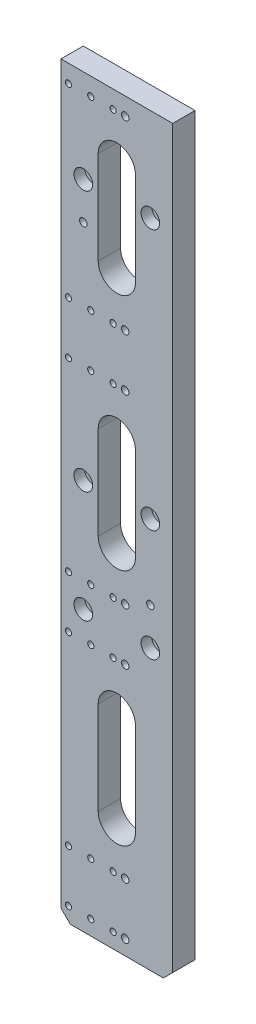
ISO-10303-21;
HEADER;
FILE_DESCRIPTION(('STEP AP214'),'2;1');
FILE_NAME('part.step','',(''),(''),'','','');
FILE_SCHEMA(('AUTOMOTIVE_DESIGN { 1 0 10303 214 1 1 1 1 }'));
ENDSEC;
DATA;
#1=APPLICATION_CONTEXT('core data for automotive mechanical design processes');
#2=APPLICATION_PROTOCOL_DEFINITION('international standard','automotive_design',2000,#1);
#3=PRODUCT_CONTEXT('',#1,'mechanical');
#4=PRODUCT('Part','Part','',(#3));
#5=PRODUCT_RELATED_PRODUCT_CATEGORY('part','',(#4));
#6=PRODUCT_DEFINITION_FORMATION('','',#4);
#7=PRODUCT_DEFINITION_CONTEXT('part definition',#1,'design');
#8=PRODUCT_DEFINITION('design','',#6,#7);
#9=PRODUCT_DEFINITION_SHAPE('','',#8);
#10=(LENGTH_UNIT() NAMED_UNIT(*) SI_UNIT(.MILLI.,.METRE.));
#11=(NAMED_UNIT(*) PLANE_ANGLE_UNIT() SI_UNIT($,.RADIAN.));
#12=(NAMED_UNIT(*) SI_UNIT($,.STERADIAN.) SOLID_ANGLE_UNIT());
#13=UNCERTAINTY_MEASURE_WITH_UNIT(LENGTH_MEASURE(1.E-05),#10,'distance_accuracy_value','');
#14=(GEOMETRIC_REPRESENTATION_CONTEXT(3) GLOBAL_UNCERTAINTY_ASSIGNED_CONTEXT((#13)) GLOBAL_UNIT_ASSIGNED_CONTEXT((#10,
#11,#12)) REPRESENTATION_CONTEXT('',''));
#15=CARTESIAN_POINT('',(0.,0.,0.));
#16=DIRECTION('',(0.,0.,1.));
#17=DIRECTION('',(1.,0.,0.));
#18=AXIS2_PLACEMENT_3D('',#15,#16,#17);
#19=CARTESIAN_POINT('',(0.,0.,0.));
#20=DIRECTION('',(0.,0.,-1.));
#21=DIRECTION('',(-1.,0.,0.));
#22=AXIS2_PLACEMENT_3D('',#19,#20,#21);
#23=PLANE('',#22);
#24=CARTESIAN_POINT('',(44.148556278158,548.812619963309,0.));
#25=DIRECTION('',(0.,0.,1.));
#26=DIRECTION('',(1.,0.,0.));
#27=AXIS2_PLACEMENT_3D('',#24,#25,#26);
#28=CIRCLE('',#27,10.);
#29=CARTESIAN_POINT('',(34.148556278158,548.812619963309,0.));
#30=VERTEX_POINT('',#29);
#31=CARTESIAN_POINT('',(54.1485562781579,548.812619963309,0.));
#32=VERTEX_POINT('',#31);
#33=EDGE_CURVE('E143',#30,#32,#28,.T.);
#34=ORIENTED_EDGE('',*,*,#33,.T.);
#35=DIRECTION('',(0.,1.,0.));
#36=VECTOR('',#35,1.);
#37=CARTESIAN_POINT('',(54.1485562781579,548.812619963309,0.));
#38=LINE('',#37,#36);
#39=CARTESIAN_POINT('',(54.1485562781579,598.812619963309,0.));
#40=VERTEX_POINT('',#39);
#41=EDGE_CURVE('E152',#32,#40,#38,.T.);
#42=ORIENTED_EDGE('',*,*,#41,.T.);
#43=CARTESIAN_POINT('',(44.148556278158,598.812619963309,0.));
#44=DIRECTION('',(0.,0.,1.));
#45=DIRECTION('',(1.,0.,0.));
#46=AXIS2_PLACEMENT_3D('',#43,#44,#45);
#47=CIRCLE('',#46,10.);
#48=CARTESIAN_POINT('',(34.1485562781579,598.812619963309,0.));
#49=VERTEX_POINT('',#48);
#50=EDGE_CURVE('E31',#40,#49,#47,.T.);
#51=ORIENTED_EDGE('',*,*,#50,.T.);
#52=DIRECTION('',(0.,-1.,0.));
#53=VECTOR('',#52,1.);
#54=CARTESIAN_POINT('',(34.148556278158,548.812619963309,0.));
#55=LINE('',#54,#53);
#56=EDGE_CURVE('E149',#49,#30,#55,.T.);
#57=ORIENTED_EDGE('',*,*,#56,.T.);
#58=EDGE_LOOP('',(#34,#42,#51,#57));
#59=FACE_BOUND('',#58,.T.);
#60=CARTESIAN_POINT('',(44.148556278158,420.812619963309,0.));
#61=DIRECTION('',(0.,0.,1.));
#62=DIRECTION('',(1.,0.,0.));
#63=AXIS2_PLACEMENT_3D('',#60,#61,#62);
#64=CIRCLE('',#63,10.);
#65=CARTESIAN_POINT('',(34.148556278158,420.812619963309,0.));
#66=VERTEX_POINT('',#65);
#67=CARTESIAN_POINT('',(54.1485562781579,420.812619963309,0.));
#68=VERTEX_POINT('',#67);
#69=EDGE_CURVE('E177',#66,#68,#64,.T.);
#70=ORIENTED_EDGE('',*,*,#69,.T.);
#71=DIRECTION('',(0.,1.,0.));
#72=VECTOR('',#71,1.);
#73=CARTESIAN_POINT('',(54.1485562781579,420.812619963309,0.));
#74=LINE('',#73,#72);
#75=CARTESIAN_POINT('',(54.1485562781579,470.812619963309,0.));
#76=VERTEX_POINT('',#75);
#77=EDGE_CURVE('E180',#68,#76,#74,.T.);
#78=ORIENTED_EDGE('',*,*,#77,.T.);
#79=CARTESIAN_POINT('',(44.148556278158,470.812619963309,0.));
#80=DIRECTION('',(0.,0.,1.));
#81=DIRECTION('',(1.,0.,0.));
#82=AXIS2_PLACEMENT_3D('',#79,#80,#81);
#83=CIRCLE('',#82,10.);
#84=CARTESIAN_POINT('',(34.148556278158,470.812619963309,0.));
#85=VERTEX_POINT('',#84);
#86=EDGE_CURVE('E184',#76,#85,#83,.T.);
#87=ORIENTED_EDGE('',*,*,#86,.T.);
#88=DIRECTION('',(0.,-1.,0.));
#89=VECTOR('',#88,1.);
#90=CARTESIAN_POINT('',(34.148556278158,420.812619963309,0.));
#91=LINE('',#90,#89);
#92=EDGE_CURVE('E187',#85,#66,#91,.T.);
#93=ORIENTED_EDGE('',*,*,#92,.T.);
#94=EDGE_LOOP('',(#70,#78,#87,#93));
#95=FACE_BOUND('',#94,.T.);
#96=CARTESIAN_POINT('',(44.148556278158,292.812619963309,0.));
#97=DIRECTION('',(0.,0.,1.));
#98=DIRECTION('',(1.,0.,0.));
#99=AXIS2_PLACEMENT_3D('',#96,#97,#98);
#100=CIRCLE('',#99,10.);
#101=CARTESIAN_POINT('',(34.148556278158,292.812619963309,0.));
#102=VERTEX_POINT('',#101);
#103=CARTESIAN_POINT('',(54.1485562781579,292.812619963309,0.));
#104=VERTEX_POINT('',#103);
#105=EDGE_CURVE('E209',#102,#104,#100,.T.);
#106=ORIENTED_EDGE('',*,*,#105,.T.);
#107=DIRECTION('',(0.,1.,0.));
#108=VECTOR('',#107,1.);
#109=CARTESIAN_POINT('',(54.1485562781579,292.812619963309,0.));
#110=LINE('',#109,#108);
#111=CARTESIAN_POINT('',(54.1485562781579,342.812619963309,0.));
#112=VERTEX_POINT('',#111);
#113=EDGE_CURVE('E212',#104,#112,#110,.T.);
#114=ORIENTED_EDGE('',*,*,#113,.T.);
#115=CARTESIAN_POINT('',(44.148556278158,342.812619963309,0.));
#116=DIRECTION('',(0.,0.,1.));
#117=DIRECTION('',(1.,0.,0.));
#118=AXIS2_PLACEMENT_3D('',#115,#116,#117);
#119=CIRCLE('',#118,10.);
#120=CARTESIAN_POINT('',(34.148556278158,342.812619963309,0.));
#121=VERTEX_POINT('',#120);
#122=EDGE_CURVE('E216',#112,#121,#119,.T.);
#123=ORIENTED_EDGE('',*,*,#122,.T.);
#124=DIRECTION('',(0.,-1.,0.));
#125=VECTOR('',#124,1.);
#126=CARTESIAN_POINT('',(34.148556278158,292.812619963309,0.));
#127=LINE('',#126,#125);
#128=EDGE_CURVE('E219',#121,#102,#127,.T.);
#129=ORIENTED_EDGE('',*,*,#128,.T.);
#130=EDGE_LOOP('',(#106,#114,#123,#129));
#131=FACE_BOUND('',#130,.T.);
#132=CARTESIAN_POINT('',(62.1485562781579,402.812619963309,0.));
#133=DIRECTION('',(0.,0.,1.));
#134=DIRECTION('',(1.,0.,0.));
#135=AXIS2_PLACEMENT_3D('',#132,#133,#134);
#136=CIRCLE('',#135,2.);
#137=CARTESIAN_POINT('',(64.1485562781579,402.812619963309,0.));
#138=VERTEX_POINT('',#137);
#139=EDGE_CURVE('E249',#138,#138,#136,.T.);
#140=ORIENTED_EDGE('',*,*,#139,.T.);
#141=EDGE_LOOP('',(#140));
#142=FACE_BOUND('',#141,.T.);
#143=CARTESIAN_POINT('',(62.1485562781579,582.812619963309,0.));
#144=DIRECTION('',(0.,0.,1.));
#145=DIRECTION('',(1.,0.,0.));
#146=AXIS2_PLACEMENT_3D('',#143,#144,#145);
#147=CIRCLE('',#146,2.75);
#148=CARTESIAN_POINT('',(64.8985562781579,582.812619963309,0.));
#149=VERTEX_POINT('',#148);
#150=EDGE_CURVE('E273',#149,#149,#147,.T.);
#151=ORIENTED_EDGE('',*,*,#150,.T.);
#152=EDGE_LOOP('',(#151));
#153=FACE_BOUND('',#152,.T.);
#154=CARTESIAN_POINT('',(62.1485562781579,382.812619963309,0.));
#155=DIRECTION('',(0.,0.,1.));
#156=DIRECTION('',(1.,0.,0.));
#157=AXIS2_PLACEMENT_3D('',#154,#155,#156);
#158=CIRCLE('',#157,2.75);
#159=CARTESIAN_POINT('',(64.8985562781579,382.812619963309,0.));
#160=VERTEX_POINT('',#159);
#161=EDGE_CURVE('E297',#160,#160,#158,.T.);
#162=ORIENTED_EDGE('',*,*,#161,.T.);
#163=EDGE_LOOP('',(#162));
#164=FACE_BOUND('',#163,.T.);
#165=CARTESIAN_POINT('',(62.1485562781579,442.812619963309,0.));
#166=DIRECTION('',(0.,0.,1.));
#167=DIRECTION('',(1.,0.,0.));
#168=AXIS2_PLACEMENT_3D('',#165,#166,#167);
#169=CIRCLE('',#168,2.75);
#170=CARTESIAN_POINT('',(64.8985562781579,442.812619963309,0.));
#171=VERTEX_POINT('',#170);
#172=EDGE_CURVE('E321',#171,#171,#169,.T.);
#173=ORIENTED_EDGE('',*,*,#172,.T.);
#174=EDGE_LOOP('',(#173));
#175=FACE_BOUND('',#174,.T.);
#176=CARTESIAN_POINT('',(18.148556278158,268.812619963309,0.));
#177=DIRECTION('',(0.,0.,1.));
#178=DIRECTION('',(1.,0.,0.));
#179=AXIS2_PLACEMENT_3D('',#176,#177,#178);
#180=CIRCLE('',#179,1.65);
#181=CARTESIAN_POINT('',(19.798556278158,268.812619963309,0.));
#182=VERTEX_POINT('',#181);
#183=EDGE_CURVE('E339',#182,#182,#180,.T.);
#184=ORIENTED_EDGE('',*,*,#183,.T.);
#185=EDGE_LOOP('',(#184));
#186=FACE_BOUND('',#185,.T.);
#187=CARTESIAN_POINT('',(30.148556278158,368.312619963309,0.));
#188=DIRECTION('',(0.,0.,1.));
#189=DIRECTION('',(1.,0.,0.));
#190=AXIS2_PLACEMENT_3D('',#187,#188,#189);
#191=CIRCLE('',#190,1.65);
#192=CARTESIAN_POINT('',(31.798556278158,368.312619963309,0.));
#193=VERTEX_POINT('',#192);
#194=EDGE_CURVE('E357',#193,#193,#191,.T.);
#195=ORIENTED_EDGE('',*,*,#194,.T.);
#196=EDGE_LOOP('',(#195));
#197=FACE_BOUND('',#196,.T.);
#198=CARTESIAN_POINT('',(30.148556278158,396.312619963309,0.));
#199=DIRECTION('',(0.,0.,1.));
#200=DIRECTION('',(1.,0.,0.));
#201=AXIS2_PLACEMENT_3D('',#198,#199,#200);
#202=CIRCLE('',#201,1.65);
#203=CARTESIAN_POINT('',(31.798556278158,396.312619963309,0.));
#204=VERTEX_POINT('',#203);
#205=EDGE_CURVE('E363',#204,#204,#202,.T.);
#206=ORIENTED_EDGE('',*,*,#205,.T.);
#207=EDGE_LOOP('',(#206));
#208=FACE_BOUND('',#207,.T.);
#209=CARTESIAN_POINT('',(30.148556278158,495.812619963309,0.));
#210=DIRECTION('',(0.,0.,1.));
#211=DIRECTION('',(1.,0.,0.));
#212=AXIS2_PLACEMENT_3D('',#209,#210,#211);
#213=CIRCLE('',#212,1.65);
#214=CARTESIAN_POINT('',(31.798556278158,495.812619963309,0.));
#215=VERTEX_POINT('',#214);
#216=EDGE_CURVE('E381',#215,#215,#213,.T.);
#217=ORIENTED_EDGE('',*,*,#216,.T.);
#218=EDGE_LOOP('',(#217));
#219=FACE_BOUND('',#218,.T.);
#220=CARTESIAN_POINT('',(18.148556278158,623.312619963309,0.));
#221=DIRECTION('',(0.,0.,1.));
#222=DIRECTION('',(1.,0.,0.));
#223=AXIS2_PLACEMENT_3D('',#220,#221,#222);
#224=CIRCLE('',#223,1.65);
#225=CARTESIAN_POINT('',(19.798556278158,623.312619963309,0.));
#226=VERTEX_POINT('',#225);
#227=EDGE_CURVE('E399',#226,#226,#224,.T.);
#228=ORIENTED_EDGE('',*,*,#227,.T.);
#229=EDGE_LOOP('',(#228));
#230=FACE_BOUND('',#229,.T.);
#231=CARTESIAN_POINT('',(30.148556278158,623.312619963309,0.));
#232=DIRECTION('',(0.,0.,1.));
#233=DIRECTION('',(1.,0.,0.));
#234=AXIS2_PLACEMENT_3D('',#231,#232,#233);
#235=CIRCLE('',#234,1.65);
#236=CARTESIAN_POINT('',(31.798556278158,623.312619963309,0.));
#237=VERTEX_POINT('',#236);
#238=EDGE_CURVE('E405',#237,#237,#235,.T.);
#239=ORIENTED_EDGE('',*,*,#238,.T.);
#240=EDGE_LOOP('',(#239));
#241=FACE_BOUND('',#240,.T.);
#242=CARTESIAN_POINT('',(42.148556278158,368.312619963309,0.));
#243=DIRECTION('',(0.,0.,1.));
#244=DIRECTION('',(1.,0.,0.));
#245=AXIS2_PLACEMENT_3D('',#242,#243,#244);
#246=CIRCLE('',#245,1.65);
#247=CARTESIAN_POINT('',(43.798556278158,368.312619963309,0.));
#248=VERTEX_POINT('',#247);
#249=EDGE_CURVE('E423',#248,#248,#246,.T.);
#250=ORIENTED_EDGE('',*,*,#249,.T.);
#251=EDGE_LOOP('',(#250));
#252=FACE_BOUND('',#251,.T.);
#253=CARTESIAN_POINT('',(42.148556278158,396.312619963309,0.));
#254=DIRECTION('',(0.,0.,1.));
#255=DIRECTION('',(1.,0.,0.));
#256=AXIS2_PLACEMENT_3D('',#253,#254,#255);
#257=CIRCLE('',#256,1.65);
#258=CARTESIAN_POINT('',(43.798556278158,396.312619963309,0.));
#259=VERTEX_POINT('',#258);
#260=EDGE_CURVE('E429',#259,#259,#257,.T.);
#261=ORIENTED_EDGE('',*,*,#260,.T.);
#262=EDGE_LOOP('',(#261));
#263=FACE_BOUND('',#262,.T.);
#264=CARTESIAN_POINT('',(42.148556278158,495.812619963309,0.));
#265=DIRECTION('',(0.,0.,1.));
#266=DIRECTION('',(1.,0.,0.));
#267=AXIS2_PLACEMENT_3D('',#264,#265,#266);
#268=CIRCLE('',#267,1.65);
#269=CARTESIAN_POINT('',(43.798556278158,495.812619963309,0.));
#270=VERTEX_POINT('',#269);
#271=EDGE_CURVE('E435',#270,#270,#268,.T.);
#272=ORIENTED_EDGE('',*,*,#271,.T.);
#273=EDGE_LOOP('',(#272));
#274=FACE_BOUND('',#273,.T.);
#275=DIRECTION('',(1.,0.,0.));
#276=VECTOR('',#275,1.);
#277=CARTESIAN_POINT('',(14.1485562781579,232.812619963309,0.));
#278=LINE('',#277,#276);
#279=CARTESIAN_POINT('',(19.1485562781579,232.812619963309,0.));
#280=VERTEX_POINT('',#279);
#281=CARTESIAN_POINT('',(69.1485562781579,232.812619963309,0.));
#282=VERTEX_POINT('',#281);
#283=EDGE_CURVE('E507',#280,#282,#278,.T.);
#284=ORIENTED_EDGE('',*,*,#283,.F.);
#285=DIRECTION('',(0.707106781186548,-0.707106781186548,0.));
#286=VECTOR('',#285,1.);
#287=CARTESIAN_POINT('',(125.980588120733,125.980588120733,0.));
#288=LINE('',#287,#286);
#289=CARTESIAN_POINT('',(14.1485562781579,237.812619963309,0.));
#290=VERTEX_POINT('',#289);
#291=EDGE_CURVE('E525',#280,#290,#288,.F.);
#292=ORIENTED_EDGE('',*,*,#291,.T.);
#293=DIRECTION('',(0.,-1.,0.));
#294=VECTOR('',#293,1.);
#295=CARTESIAN_POINT('',(14.1485562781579,232.812619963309,0.));
#296=LINE('',#295,#294);
#297=CARTESIAN_POINT('',(14.1485562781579,632.812619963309,0.));
#298=VERTEX_POINT('',#297);
#299=EDGE_CURVE('E492',#298,#290,#296,.T.);
#300=ORIENTED_EDGE('',*,*,#299,.F.);
#301=DIRECTION('',(-1.,0.,0.));
#302=VECTOR('',#301,1.);
#303=CARTESIAN_POINT('',(14.1485562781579,632.812619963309,0.));
#304=LINE('',#303,#302);
#305=CARTESIAN_POINT('',(74.1485562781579,632.812619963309,0.));
#306=VERTEX_POINT('',#305);
#307=EDGE_CURVE('E497',#306,#298,#304,.T.);
#308=ORIENTED_EDGE('',*,*,#307,.F.);
#309=DIRECTION('',(0.,1.,0.));
#310=VECTOR('',#309,1.);
#311=CARTESIAN_POINT('',(74.1485562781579,232.812619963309,0.));
#312=LINE('',#311,#310);
#313=CARTESIAN_POINT('',(74.1485562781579,237.812619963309,0.));
#314=VERTEX_POINT('',#313);
#315=EDGE_CURVE('E510',#314,#306,#312,.T.);
#316=ORIENTED_EDGE('',*,*,#315,.F.);
#317=DIRECTION('',(0.707106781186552,0.707106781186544,0.));
#318=VECTOR('',#317,1.);
#319=CARTESIAN_POINT('',(-81.832031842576,81.8320318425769,0.));
#320=LINE('',#319,#318);
#321=EDGE_CURVE('E523',#314,#282,#320,.F.);
#322=ORIENTED_EDGE('',*,*,#321,.T.);
#323=EDGE_LOOP('',(#284,#292,#300,#308,#316,#322));
#324=FACE_BOUND('',#323,.T.);
#325=CARTESIAN_POINT('',(48.6485562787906,623.312619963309,0.));
#326=DIRECTION('',(0.,0.,1.));
#327=DIRECTION('',(1.,0.,0.));
#328=AXIS2_PLACEMENT_3D('',#325,#326,#327);
#329=CIRCLE('',#328,2.);
#330=CARTESIAN_POINT('',(50.6485562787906,623.312619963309,0.));
#331=VERTEX_POINT('',#330);
#332=EDGE_CURVE('E489',#331,#331,#329,.T.);
#333=ORIENTED_EDGE('',*,*,#332,.T.);
#334=EDGE_LOOP('',(#333));
#335=FACE_BOUND('',#334,.T.);
#336=CARTESIAN_POINT('',(48.6485562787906,523.812619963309,0.));
#337=DIRECTION('',(0.,0.,1.));
#338=DIRECTION('',(1.,0.,0.));
#339=AXIS2_PLACEMENT_3D('',#336,#337,#338);
#340=CIRCLE('',#339,2.);
#341=CARTESIAN_POINT('',(50.6485562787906,523.812619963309,0.));
#342=VERTEX_POINT('',#341);
#343=EDGE_CURVE('E483',#342,#342,#340,.T.);
#344=ORIENTED_EDGE('',*,*,#343,.T.);
#345=EDGE_LOOP('',(#344));
#346=FACE_BOUND('',#345,.T.);
#347=CARTESIAN_POINT('',(48.6485562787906,495.812619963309,0.));
#348=DIRECTION('',(0.,0.,1.));
#349=DIRECTION('',(1.,0.,0.));
#350=AXIS2_PLACEMENT_3D('',#347,#348,#349);
#351=CIRCLE('',#350,2.);
#352=CARTESIAN_POINT('',(50.6485562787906,495.812619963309,0.));
#353=VERTEX_POINT('',#352);
#354=EDGE_CURVE('E477',#353,#353,#351,.T.);
#355=ORIENTED_EDGE('',*,*,#354,.T.);
#356=EDGE_LOOP('',(#355));
#357=FACE_BOUND('',#356,.T.);
#358=CARTESIAN_POINT('',(48.6485562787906,396.312619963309,0.));
#359=DIRECTION('',(0.,0.,1.));
#360=DIRECTION('',(1.,0.,0.));
#361=AXIS2_PLACEMENT_3D('',#358,#359,#360);
#362=CIRCLE('',#361,2.);
#363=CARTESIAN_POINT('',(50.6485562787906,396.312619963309,0.));
#364=VERTEX_POINT('',#363);
#365=EDGE_CURVE('E471',#364,#364,#362,.T.);
#366=ORIENTED_EDGE('',*,*,#365,.T.);
#367=EDGE_LOOP('',(#366));
#368=FACE_BOUND('',#367,.T.);
#369=CARTESIAN_POINT('',(48.6485562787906,368.312619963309,0.));
#370=DIRECTION('',(0.,0.,1.));
#371=DIRECTION('',(1.,0.,0.));
#372=AXIS2_PLACEMENT_3D('',#369,#370,#371);
#373=CIRCLE('',#372,2.);
#374=CARTESIAN_POINT('',(50.6485562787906,368.312619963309,0.));
#375=VERTEX_POINT('',#374);
#376=EDGE_CURVE('E465',#375,#375,#373,.T.);
#377=ORIENTED_EDGE('',*,*,#376,.T.);
#378=EDGE_LOOP('',(#377));
#379=FACE_BOUND('',#378,.T.);
#380=CARTESIAN_POINT('',(48.6485562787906,268.812619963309,0.));
#381=DIRECTION('',(0.,0.,1.));
#382=DIRECTION('',(1.,0.,0.));
#383=AXIS2_PLACEMENT_3D('',#380,#381,#382);
#384=CIRCLE('',#383,2.);
#385=CARTESIAN_POINT('',(50.6485562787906,268.812619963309,0.));
#386=VERTEX_POINT('',#385);
#387=EDGE_CURVE('E459',#386,#386,#384,.T.);
#388=ORIENTED_EDGE('',*,*,#387,.T.);
#389=EDGE_LOOP('',(#388));
#390=FACE_BOUND('',#389,.T.);
#391=CARTESIAN_POINT('',(48.6485562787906,240.812619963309,0.));
#392=DIRECTION('',(0.,0.,1.));
#393=DIRECTION('',(1.,0.,0.));
#394=AXIS2_PLACEMENT_3D('',#391,#392,#393);
#395=CIRCLE('',#394,2.);
#396=CARTESIAN_POINT('',(50.6485562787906,240.812619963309,0.));
#397=VERTEX_POINT('',#396);
#398=EDGE_CURVE('E453',#397,#397,#395,.T.);
#399=ORIENTED_EDGE('',*,*,#398,.T.);
#400=EDGE_LOOP('',(#399));
#401=FACE_BOUND('',#400,.T.);
#402=CARTESIAN_POINT('',(42.148556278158,623.312619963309,0.));
#403=DIRECTION('',(0.,0.,1.));
#404=DIRECTION('',(1.,0.,0.));
#405=AXIS2_PLACEMENT_3D('',#402,#403,#404);
#406=CIRCLE('',#405,1.65);
#407=CARTESIAN_POINT('',(43.798556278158,623.312619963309,0.));
#408=VERTEX_POINT('',#407);
#409=EDGE_CURVE('E447',#408,#408,#406,.T.);
#410=ORIENTED_EDGE('',*,*,#409,.T.);
#411=EDGE_LOOP('',(#410));
#412=FACE_BOUND('',#411,.T.);
#413=CARTESIAN_POINT('',(42.148556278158,523.812619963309,0.));
#414=DIRECTION('',(0.,0.,1.));
#415=DIRECTION('',(1.,0.,0.));
#416=AXIS2_PLACEMENT_3D('',#413,#414,#415);
#417=CIRCLE('',#416,1.65);
#418=CARTESIAN_POINT('',(43.798556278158,523.812619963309,0.));
#419=VERTEX_POINT('',#418);
#420=EDGE_CURVE('E441',#419,#419,#417,.T.);
#421=ORIENTED_EDGE('',*,*,#420,.T.);
#422=EDGE_LOOP('',(#421));
#423=FACE_BOUND('',#422,.T.);
#424=CARTESIAN_POINT('',(42.148556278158,268.812619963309,0.));
#425=DIRECTION('',(0.,0.,1.));
#426=DIRECTION('',(1.,0.,0.));
#427=AXIS2_PLACEMENT_3D('',#424,#425,#426);
#428=CIRCLE('',#427,1.65);
#429=CARTESIAN_POINT('',(43.798556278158,268.812619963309,0.));
#430=VERTEX_POINT('',#429);
#431=EDGE_CURVE('E417',#430,#430,#428,.T.);
#432=ORIENTED_EDGE('',*,*,#431,.T.);
#433=EDGE_LOOP('',(#432));
#434=FACE_BOUND('',#433,.T.);
#435=CARTESIAN_POINT('',(42.148556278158,240.812619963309,0.));
#436=DIRECTION('',(0.,0.,1.));
#437=DIRECTION('',(1.,0.,0.));
#438=AXIS2_PLACEMENT_3D('',#435,#436,#437);
#439=CIRCLE('',#438,1.65);
#440=CARTESIAN_POINT('',(43.798556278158,240.812619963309,0.));
#441=VERTEX_POINT('',#440);
#442=EDGE_CURVE('E411',#441,#441,#439,.T.);
#443=ORIENTED_EDGE('',*,*,#442,.T.);
#444=EDGE_LOOP('',(#443));
#445=FACE_BOUND('',#444,.T.);
#446=CARTESIAN_POINT('',(30.148556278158,523.812619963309,0.));
#447=DIRECTION('',(0.,0.,1.));
#448=DIRECTION('',(1.,0.,0.));
#449=AXIS2_PLACEMENT_3D('',#446,#447,#448);
#450=CIRCLE('',#449,1.65);
#451=CARTESIAN_POINT('',(31.798556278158,523.812619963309,0.));
#452=VERTEX_POINT('',#451);
#453=EDGE_CURVE('E393',#452,#452,#450,.T.);
#454=ORIENTED_EDGE('',*,*,#453,.T.);
#455=EDGE_LOOP('',(#454));
#456=FACE_BOUND('',#455,.T.);
#457=CARTESIAN_POINT('',(18.148556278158,523.812619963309,0.));
#458=DIRECTION('',(0.,0.,1.));
#459=DIRECTION('',(1.,0.,0.));
#460=AXIS2_PLACEMENT_3D('',#457,#458,#459);
#461=CIRCLE('',#460,1.65);
#462=CARTESIAN_POINT('',(19.798556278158,523.812619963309,0.));
#463=VERTEX_POINT('',#462);
#464=EDGE_CURVE('E387',#463,#463,#461,.T.);
#465=ORIENTED_EDGE('',*,*,#464,.T.);
#466=EDGE_LOOP('',(#465));
#467=FACE_BOUND('',#466,.T.);
#468=CARTESIAN_POINT('',(18.148556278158,495.812619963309,0.));
#469=DIRECTION('',(0.,0.,1.));
#470=DIRECTION('',(1.,0.,0.));
#471=AXIS2_PLACEMENT_3D('',#468,#469,#470);
#472=CIRCLE('',#471,1.65);
#473=CARTESIAN_POINT('',(19.798556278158,495.812619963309,0.));
#474=VERTEX_POINT('',#473);
#475=EDGE_CURVE('E375',#474,#474,#472,.T.);
#476=ORIENTED_EDGE('',*,*,#475,.T.);
#477=EDGE_LOOP('',(#476));
#478=FACE_BOUND('',#477,.T.);
#479=CARTESIAN_POINT('',(18.148556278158,396.312619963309,0.));
#480=DIRECTION('',(0.,0.,1.));
#481=DIRECTION('',(1.,0.,0.));
#482=AXIS2_PLACEMENT_3D('',#479,#480,#481);
#483=CIRCLE('',#482,1.65);
#484=CARTESIAN_POINT('',(19.798556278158,396.312619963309,0.));
#485=VERTEX_POINT('',#484);
#486=EDGE_CURVE('E369',#485,#485,#483,.T.);
#487=ORIENTED_EDGE('',*,*,#486,.T.);
#488=EDGE_LOOP('',(#487));
#489=FACE_BOUND('',#488,.T.);
#490=CARTESIAN_POINT('',(18.148556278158,368.312619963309,0.));
#491=DIRECTION('',(0.,0.,1.));
#492=DIRECTION('',(1.,0.,0.));
#493=AXIS2_PLACEMENT_3D('',#490,#491,#492);
#494=CIRCLE('',#493,1.65);
#495=CARTESIAN_POINT('',(19.798556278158,368.312619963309,0.));
#496=VERTEX_POINT('',#495);
#497=EDGE_CURVE('E351',#496,#496,#494,.T.);
#498=ORIENTED_EDGE('',*,*,#497,.T.);
#499=EDGE_LOOP('',(#498));
#500=FACE_BOUND('',#499,.T.);
#501=CARTESIAN_POINT('',(30.148556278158,268.812619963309,0.));
#502=DIRECTION('',(0.,0.,1.));
#503=DIRECTION('',(1.,0.,0.));
#504=AXIS2_PLACEMENT_3D('',#501,#502,#503);
#505=CIRCLE('',#504,1.65);
#506=CARTESIAN_POINT('',(31.798556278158,268.812619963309,0.));
#507=VERTEX_POINT('',#506);
#508=EDGE_CURVE('E345',#507,#507,#505,.T.);
#509=ORIENTED_EDGE('',*,*,#508,.T.);
#510=EDGE_LOOP('',(#509));
#511=FACE_BOUND('',#510,.T.);
#512=CARTESIAN_POINT('',(18.148556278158,240.812619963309,0.));
#513=DIRECTION('',(0.,0.,1.));
#514=DIRECTION('',(1.,0.,0.));
#515=AXIS2_PLACEMENT_3D('',#512,#513,#514);
#516=CIRCLE('',#515,1.65);
#517=CARTESIAN_POINT('',(19.798556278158,240.812619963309,0.));
#518=VERTEX_POINT('',#517);
#519=EDGE_CURVE('E333',#518,#518,#516,.T.);
#520=ORIENTED_EDGE('',*,*,#519,.T.);
#521=EDGE_LOOP('',(#520));
#522=FACE_BOUND('',#521,.T.);
#523=CARTESIAN_POINT('',(30.148556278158,240.812619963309,0.));
#524=DIRECTION('',(0.,0.,1.));
#525=DIRECTION('',(1.,0.,0.));
#526=AXIS2_PLACEMENT_3D('',#523,#524,#525);
#527=CIRCLE('',#526,1.65);
#528=CARTESIAN_POINT('',(31.798556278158,240.812619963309,0.));
#529=VERTEX_POINT('',#528);
#530=EDGE_CURVE('E327',#529,#529,#527,.T.);
#531=ORIENTED_EDGE('',*,*,#530,.T.);
#532=EDGE_LOOP('',(#531));
#533=FACE_BOUND('',#532,.T.);
#534=CARTESIAN_POINT('',(26.1485562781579,442.812619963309,0.));
#535=DIRECTION('',(0.,0.,1.));
#536=DIRECTION('',(1.,0.,0.));
#537=AXIS2_PLACEMENT_3D('',#534,#535,#536);
#538=CIRCLE('',#537,2.75);
#539=CARTESIAN_POINT('',(28.8985562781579,442.812619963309,0.));
#540=VERTEX_POINT('',#539);
#541=EDGE_CURVE('E309',#540,#540,#538,.T.);
#542=ORIENTED_EDGE('',*,*,#541,.T.);
#543=EDGE_LOOP('',(#542));
#544=FACE_BOUND('',#543,.T.);
#545=CARTESIAN_POINT('',(26.1485562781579,382.812619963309,0.));
#546=DIRECTION('',(0.,0.,1.));
#547=DIRECTION('',(1.,0.,0.));
#548=AXIS2_PLACEMENT_3D('',#545,#546,#547);
#549=CIRCLE('',#548,2.75);
#550=CARTESIAN_POINT('',(28.8985562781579,382.812619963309,0.));
#551=VERTEX_POINT('',#550);
#552=EDGE_CURVE('E285',#551,#551,#549,.T.);
#553=ORIENTED_EDGE('',*,*,#552,.T.);
#554=EDGE_LOOP('',(#553));
#555=FACE_BOUND('',#554,.T.);
#556=CARTESIAN_POINT('',(26.1485562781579,582.812619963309,0.));
#557=DIRECTION('',(0.,0.,1.));
#558=DIRECTION('',(1.,0.,0.));
#559=AXIS2_PLACEMENT_3D('',#556,#557,#558);
#560=CIRCLE('',#559,2.75);
#561=CARTESIAN_POINT('',(28.8985562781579,582.812619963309,0.));
#562=VERTEX_POINT('',#561);
#563=EDGE_CURVE('E261',#562,#562,#560,.T.);
#564=ORIENTED_EDGE('',*,*,#563,.T.);
#565=EDGE_LOOP('',(#564));
#566=FACE_BOUND('',#565,.T.);
#567=CARTESIAN_POINT('',(26.1485562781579,562.812619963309,0.));
#568=DIRECTION('',(0.,0.,1.));
#569=DIRECTION('',(1.,0.,0.));
#570=AXIS2_PLACEMENT_3D('',#567,#568,#569);
#571=CIRCLE('',#570,2.);
#572=CARTESIAN_POINT('',(28.1485562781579,562.812619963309,0.));
#573=VERTEX_POINT('',#572);
#574=EDGE_CURVE('E243',#573,#573,#571,.T.);
#575=ORIENTED_EDGE('',*,*,#574,.T.);
#576=EDGE_LOOP('',(#575));
#577=FACE_BOUND('',#576,.T.);
#578=ADVANCED_FACE('F16',(#59,#95,#131,#142,#153,#164,#175,#186,#197,#208,#219,#230,#241,#252,
#263,#274,#324,#335,#346,#357,#368,#379,#390,#401,#412,#423,#434,#445,#456,#467,#478,#489,#500,
#511,#522,#533,#544,#555,#566,#577),#23,.T.);
#579=CARTESIAN_POINT('',(0.,0.,12.));
#580=DIRECTION('',(0.,0.,-1.));
#581=DIRECTION('',(-1.,0.,0.));
#582=AXIS2_PLACEMENT_3D('',#579,#580,#581);
#583=PLANE('',#582);
#584=DIRECTION('',(0.,1.,0.));
#585=VECTOR('',#584,1.);
#586=CARTESIAN_POINT('',(54.1485562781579,548.812619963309,12.));
#587=LINE('',#586,#585);
#588=CARTESIAN_POINT('',(54.1485562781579,548.812619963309,12.));
#589=VERTEX_POINT('',#588);
#590=CARTESIAN_POINT('',(54.1485562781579,598.812619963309,12.));
#591=VERTEX_POINT('',#590);
#592=EDGE_CURVE('E167',#589,#591,#587,.T.);
#593=ORIENTED_EDGE('',*,*,#592,.F.);
#594=CARTESIAN_POINT('',(44.148556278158,548.812619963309,12.));
#595=DIRECTION('',(0.,0.,1.));
#596=DIRECTION('',(1.,0.,0.));
#597=AXIS2_PLACEMENT_3D('',#594,#595,#596);
#598=CIRCLE('',#597,10.);
#599=CARTESIAN_POINT('',(34.148556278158,548.812619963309,12.));
#600=VERTEX_POINT('',#599);
#601=EDGE_CURVE('E39',#600,#589,#598,.T.);
#602=ORIENTED_EDGE('',*,*,#601,.F.);
#603=DIRECTION('',(0.,-1.,0.));
#604=VECTOR('',#603,1.);
#605=CARTESIAN_POINT('',(34.148556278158,548.812619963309,12.));
#606=LINE('',#605,#604);
#607=CARTESIAN_POINT('',(34.1485562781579,598.812619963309,12.));
#608=VERTEX_POINT('',#607);
#609=EDGE_CURVE('E158',#608,#600,#606,.T.);
#610=ORIENTED_EDGE('',*,*,#609,.F.);
#611=CARTESIAN_POINT('',(44.148556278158,598.812619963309,12.));
#612=DIRECTION('',(0.,0.,1.));
#613=DIRECTION('',(1.,0.,0.));
#614=AXIS2_PLACEMENT_3D('',#611,#612,#613);
#615=CIRCLE('',#614,10.);
#616=EDGE_CURVE('E161',#591,#608,#615,.T.);
#617=ORIENTED_EDGE('',*,*,#616,.F.);
#618=EDGE_LOOP('',(#593,#602,#610,#617));
#619=FACE_BOUND('',#618,.T.);
#620=DIRECTION('',(0.,1.,0.));
#621=VECTOR('',#620,1.);
#622=CARTESIAN_POINT('',(54.1485562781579,420.812619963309,12.));
#623=LINE('',#622,#621);
#624=CARTESIAN_POINT('',(54.1485562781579,420.812619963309,12.));
#625=VERTEX_POINT('',#624);
#626=CARTESIAN_POINT('',(54.1485562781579,470.812619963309,12.));
#627=VERTEX_POINT('',#626);
#628=EDGE_CURVE('E192',#625,#627,#623,.T.);
#629=ORIENTED_EDGE('',*,*,#628,.F.);
#630=CARTESIAN_POINT('',(44.148556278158,420.812619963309,12.));
#631=DIRECTION('',(0.,0.,1.));
#632=DIRECTION('',(1.,0.,0.));
#633=AXIS2_PLACEMENT_3D('',#630,#631,#632);
#634=CIRCLE('',#633,10.);
#635=CARTESIAN_POINT('',(34.148556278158,420.812619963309,12.));
#636=VERTEX_POINT('',#635);
#637=EDGE_CURVE('E173',#636,#625,#634,.T.);
#638=ORIENTED_EDGE('',*,*,#637,.F.);
#639=DIRECTION('',(0.,-1.,0.));
#640=VECTOR('',#639,1.);
#641=CARTESIAN_POINT('',(34.148556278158,420.812619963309,12.));
#642=LINE('',#641,#640);
#643=CARTESIAN_POINT('',(34.148556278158,470.812619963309,12.));
#644=VERTEX_POINT('',#643);
#645=EDGE_CURVE('E181',#644,#636,#642,.T.);
#646=ORIENTED_EDGE('',*,*,#645,.F.);
#647=CARTESIAN_POINT('',(44.148556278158,470.812619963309,12.));
#648=DIRECTION('',(0.,0.,1.));
#649=DIRECTION('',(1.,0.,0.));
#650=AXIS2_PLACEMENT_3D('',#647,#648,#649);
#651=CIRCLE('',#650,10.);
#652=EDGE_CURVE('E195',#627,#644,#651,.T.);
#653=ORIENTED_EDGE('',*,*,#652,.F.);
#654=EDGE_LOOP('',(#629,#638,#646,#653));
#655=FACE_BOUND('',#654,.T.);
#656=DIRECTION('',(0.,1.,0.));
#657=VECTOR('',#656,1.);
#658=CARTESIAN_POINT('',(54.1485562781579,292.812619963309,12.));
#659=LINE('',#658,#657);
#660=CARTESIAN_POINT('',(54.1485562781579,292.812619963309,12.));
#661=VERTEX_POINT('',#660);
#662=CARTESIAN_POINT('',(54.1485562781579,342.812619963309,12.));
#663=VERTEX_POINT('',#662);
#664=EDGE_CURVE('E224',#661,#663,#659,.T.);
#665=ORIENTED_EDGE('',*,*,#664,.F.);
#666=CARTESIAN_POINT('',(44.148556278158,292.812619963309,12.));
#667=DIRECTION('',(0.,0.,1.));
#668=DIRECTION('',(1.,0.,0.));
#669=AXIS2_PLACEMENT_3D('',#666,#667,#668);
#670=CIRCLE('',#669,10.);
#671=CARTESIAN_POINT('',(34.148556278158,292.812619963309,12.));
#672=VERTEX_POINT('',#671);
#673=EDGE_CURVE('E202',#672,#661,#670,.T.);
#674=ORIENTED_EDGE('',*,*,#673,.F.);
#675=DIRECTION('',(0.,-1.,0.));
#676=VECTOR('',#675,1.);
#677=CARTESIAN_POINT('',(34.148556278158,292.812619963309,12.));
#678=LINE('',#677,#676);
#679=CARTESIAN_POINT('',(34.148556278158,342.812619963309,12.));
#680=VERTEX_POINT('',#679);
#681=EDGE_CURVE('E213',#680,#672,#678,.T.);
#682=ORIENTED_EDGE('',*,*,#681,.F.);
#683=CARTESIAN_POINT('',(44.148556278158,342.812619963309,12.));
#684=DIRECTION('',(0.,0.,1.));
#685=DIRECTION('',(1.,0.,0.));
#686=AXIS2_PLACEMENT_3D('',#683,#684,#685);
#687=CIRCLE('',#686,10.);
#688=EDGE_CURVE('E227',#663,#680,#687,.T.);
#689=ORIENTED_EDGE('',*,*,#688,.F.);
#690=EDGE_LOOP('',(#665,#674,#682,#689));
#691=FACE_BOUND('',#690,.T.);
#692=CARTESIAN_POINT('',(26.1485562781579,442.812619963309,12.));
#693=DIRECTION('',(0.,0.,1.));
#694=DIRECTION('',(1.,0.,0.));
#695=AXIS2_PLACEMENT_3D('',#692,#693,#694);
#696=CIRCLE('',#695,5.);
#697=CARTESIAN_POINT('',(31.1485562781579,442.812619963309,12.));
#698=VERTEX_POINT('',#697);
#699=EDGE_CURVE('E300',#698,#698,#696,.T.);
#700=ORIENTED_EDGE('',*,*,#699,.F.);
#701=EDGE_LOOP('',(#700));
#702=FACE_BOUND('',#701,.T.);
#703=CARTESIAN_POINT('',(18.148556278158,268.812619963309,12.));
#704=DIRECTION('',(0.,0.,1.));
#705=DIRECTION('',(1.,0.,0.));
#706=AXIS2_PLACEMENT_3D('',#703,#704,#705);
#707=CIRCLE('',#706,1.65);
#708=CARTESIAN_POINT('',(19.798556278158,268.812619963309,12.));
#709=VERTEX_POINT('',#708);
#710=EDGE_CURVE('E336',#709,#709,#707,.T.);
#711=ORIENTED_EDGE('',*,*,#710,.F.);
#712=EDGE_LOOP('',(#711));
#713=FACE_BOUND('',#712,.T.);
#714=CARTESIAN_POINT('',(30.148556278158,368.312619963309,12.));
#715=DIRECTION('',(0.,0.,1.));
#716=DIRECTION('',(1.,0.,0.));
#717=AXIS2_PLACEMENT_3D('',#714,#715,#716);
#718=CIRCLE('',#717,1.65);
#719=CARTESIAN_POINT('',(31.798556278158,368.312619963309,12.));
#720=VERTEX_POINT('',#719);
#721=EDGE_CURVE('E354',#720,#720,#718,.T.);
#722=ORIENTED_EDGE('',*,*,#721,.F.);
#723=EDGE_LOOP('',(#722));
#724=FACE_BOUND('',#723,.T.);
#725=CARTESIAN_POINT('',(18.148556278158,396.312619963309,12.));
#726=DIRECTION('',(0.,0.,1.));
#727=DIRECTION('',(1.,0.,0.));
#728=AXIS2_PLACEMENT_3D('',#725,#726,#727);
#729=CIRCLE('',#728,1.65);
#730=CARTESIAN_POINT('',(19.798556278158,396.312619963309,12.));
#731=VERTEX_POINT('',#730);
#732=EDGE_CURVE('E366',#731,#731,#729,.T.);
#733=ORIENTED_EDGE('',*,*,#732,.F.);
#734=EDGE_LOOP('',(#733));
#735=FACE_BOUND('',#734,.T.);
#736=CARTESIAN_POINT('',(30.148556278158,495.812619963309,12.));
#737=DIRECTION('',(0.,0.,1.));
#738=DIRECTION('',(1.,0.,0.));
#739=AXIS2_PLACEMENT_3D('',#736,#737,#738);
#740=CIRCLE('',#739,1.65);
#741=CARTESIAN_POINT('',(31.798556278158,495.812619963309,12.));
#742=VERTEX_POINT('',#741);
#743=EDGE_CURVE('E378',#742,#742,#740,.T.);
#744=ORIENTED_EDGE('',*,*,#743,.F.);
#745=EDGE_LOOP('',(#744));
#746=FACE_BOUND('',#745,.T.);
#747=CARTESIAN_POINT('',(18.148556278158,623.312619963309,12.));
#748=DIRECTION('',(0.,0.,1.));
#749=DIRECTION('',(1.,0.,0.));
#750=AXIS2_PLACEMENT_3D('',#747,#748,#749);
#751=CIRCLE('',#750,1.65);
#752=CARTESIAN_POINT('',(19.798556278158,623.312619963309,12.));
#753=VERTEX_POINT('',#752);
#754=EDGE_CURVE('E396',#753,#753,#751,.T.);
#755=ORIENTED_EDGE('',*,*,#754,.F.);
#756=EDGE_LOOP('',(#755));
#757=FACE_BOUND('',#756,.T.);
#758=CARTESIAN_POINT('',(42.148556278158,240.812619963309,12.));
#759=DIRECTION('',(0.,0.,1.));
#760=DIRECTION('',(1.,0.,0.));
#761=AXIS2_PLACEMENT_3D('',#758,#759,#760);
#762=CIRCLE('',#761,1.65);
#763=CARTESIAN_POINT('',(43.798556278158,240.812619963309,12.));
#764=VERTEX_POINT('',#763);
#765=EDGE_CURVE('E408',#764,#764,#762,.T.);
#766=ORIENTED_EDGE('',*,*,#765,.F.);
#767=EDGE_LOOP('',(#766));
#768=FACE_BOUND('',#767,.T.);
#769=CARTESIAN_POINT('',(42.148556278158,368.312619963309,12.));
#770=DIRECTION('',(0.,0.,1.));
#771=DIRECTION('',(1.,0.,0.));
#772=AXIS2_PLACEMENT_3D('',#769,#770,#771);
#773=CIRCLE('',#772,1.65);
#774=CARTESIAN_POINT('',(43.798556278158,368.312619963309,12.));
#775=VERTEX_POINT('',#774);
#776=EDGE_CURVE('E420',#775,#775,#773,.T.);
#777=ORIENTED_EDGE('',*,*,#776,.F.);
#778=EDGE_LOOP('',(#777));
#779=FACE_BOUND('',#778,.T.);
#780=CARTESIAN_POINT('',(42.148556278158,523.812619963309,12.));
#781=DIRECTION('',(0.,0.,1.));
#782=DIRECTION('',(1.,0.,0.));
#783=AXIS2_PLACEMENT_3D('',#780,#781,#782);
#784=CIRCLE('',#783,1.65);
#785=CARTESIAN_POINT('',(43.798556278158,523.812619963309,12.));
#786=VERTEX_POINT('',#785);
#787=EDGE_CURVE('E438',#786,#786,#784,.T.);
#788=ORIENTED_EDGE('',*,*,#787,.F.);
#789=EDGE_LOOP('',(#788));
#790=FACE_BOUND('',#789,.T.);
#791=CARTESIAN_POINT('',(42.148556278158,623.312619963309,12.));
#792=DIRECTION('',(0.,0.,1.));
#793=DIRECTION('',(1.,0.,0.));
#794=AXIS2_PLACEMENT_3D('',#791,#792,#793);
#795=CIRCLE('',#794,1.65);
#796=CARTESIAN_POINT('',(43.798556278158,623.312619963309,12.));
#797=VERTEX_POINT('',#796);
#798=EDGE_CURVE('E444',#797,#797,#795,.T.);
#799=ORIENTED_EDGE('',*,*,#798,.F.);
#800=EDGE_LOOP('',(#799));
#801=FACE_BOUND('',#800,.T.);
#802=CARTESIAN_POINT('',(48.6485562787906,240.812619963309,12.));
#803=DIRECTION('',(0.,0.,1.));
#804=DIRECTION('',(1.,0.,0.));
#805=AXIS2_PLACEMENT_3D('',#802,#803,#804);
#806=CIRCLE('',#805,2.);
#807=CARTESIAN_POINT('',(50.6485562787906,240.812619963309,12.));
#808=VERTEX_POINT('',#807);
#809=EDGE_CURVE('E450',#808,#808,#806,.T.);
#810=ORIENTED_EDGE('',*,*,#809,.F.);
#811=EDGE_LOOP('',(#810));
#812=FACE_BOUND('',#811,.T.);
#813=CARTESIAN_POINT('',(48.6485562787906,268.812619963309,12.));
#814=DIRECTION('',(0.,0.,1.));
#815=DIRECTION('',(1.,0.,0.));
#816=AXIS2_PLACEMENT_3D('',#813,#814,#815);
#817=CIRCLE('',#816,2.);
#818=CARTESIAN_POINT('',(50.6485562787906,268.812619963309,12.));
#819=VERTEX_POINT('',#818);
#820=EDGE_CURVE('E456',#819,#819,#817,.T.);
#821=ORIENTED_EDGE('',*,*,#820,.F.);
#822=EDGE_LOOP('',(#821));
#823=FACE_BOUND('',#822,.T.);
#824=CARTESIAN_POINT('',(48.6485562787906,368.312619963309,12.));
#825=DIRECTION('',(0.,0.,1.));
#826=DIRECTION('',(1.,0.,0.));
#827=AXIS2_PLACEMENT_3D('',#824,#825,#826);
#828=CIRCLE('',#827,2.);
#829=CARTESIAN_POINT('',(50.6485562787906,368.312619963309,12.));
#830=VERTEX_POINT('',#829);
#831=EDGE_CURVE('E462',#830,#830,#828,.T.);
#832=ORIENTED_EDGE('',*,*,#831,.F.);
#833=EDGE_LOOP('',(#832));
#834=FACE_BOUND('',#833,.T.);
#835=CARTESIAN_POINT('',(48.6485562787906,396.312619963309,12.));
#836=DIRECTION('',(0.,0.,1.));
#837=DIRECTION('',(1.,0.,0.));
#838=AXIS2_PLACEMENT_3D('',#835,#836,#837);
#839=CIRCLE('',#838,2.);
#840=CARTESIAN_POINT('',(50.6485562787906,396.312619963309,12.));
#841=VERTEX_POINT('',#840);
#842=EDGE_CURVE('E468',#841,#841,#839,.T.);
#843=ORIENTED_EDGE('',*,*,#842,.F.);
#844=EDGE_LOOP('',(#843));
#845=FACE_BOUND('',#844,.T.);
#846=CARTESIAN_POINT('',(48.6485562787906,495.812619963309,12.));
#847=DIRECTION('',(0.,0.,1.));
#848=DIRECTION('',(1.,0.,0.));
#849=AXIS2_PLACEMENT_3D('',#846,#847,#848);
#850=CIRCLE('',#849,2.);
#851=CARTESIAN_POINT('',(50.6485562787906,495.812619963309,12.));
#852=VERTEX_POINT('',#851);
#853=EDGE_CURVE('E474',#852,#852,#850,.T.);
#854=ORIENTED_EDGE('',*,*,#853,.F.);
#855=EDGE_LOOP('',(#854));
#856=FACE_BOUND('',#855,.T.);
#857=CARTESIAN_POINT('',(48.6485562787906,523.812619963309,12.));
#858=DIRECTION('',(0.,0.,1.));
#859=DIRECTION('',(1.,0.,0.));
#860=AXIS2_PLACEMENT_3D('',#857,#858,#859);
#861=CIRCLE('',#860,2.);
#862=CARTESIAN_POINT('',(50.6485562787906,523.812619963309,12.));
#863=VERTEX_POINT('',#862);
#864=EDGE_CURVE('E480',#863,#863,#861,.T.);
#865=ORIENTED_EDGE('',*,*,#864,.F.);
#866=EDGE_LOOP('',(#865));
#867=FACE_BOUND('',#866,.T.);
#868=CARTESIAN_POINT('',(48.6485562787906,623.312619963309,12.));
#869=DIRECTION('',(0.,0.,1.));
#870=DIRECTION('',(1.,0.,0.));
#871=AXIS2_PLACEMENT_3D('',#868,#869,#870);
#872=CIRCLE('',#871,2.);
#873=CARTESIAN_POINT('',(50.6485562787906,623.312619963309,12.));
#874=VERTEX_POINT('',#873);
#875=EDGE_CURVE('E486',#874,#874,#872,.T.);
#876=ORIENTED_EDGE('',*,*,#875,.F.);
#877=EDGE_LOOP('',(#876));
#878=FACE_BOUND('',#877,.T.);
#879=DIRECTION('',(0.,-1.,0.));
#880=VECTOR('',#879,1.);
#881=CARTESIAN_POINT('',(14.1485562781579,232.812619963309,12.));
#882=LINE('',#881,#880);
#883=CARTESIAN_POINT('',(14.1485562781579,632.812619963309,12.));
#884=VERTEX_POINT('',#883);
#885=CARTESIAN_POINT('',(14.1485562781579,237.812619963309,12.));
#886=VERTEX_POINT('',#885);
#887=EDGE_CURVE('E493',#884,#886,#882,.T.);
#888=ORIENTED_EDGE('',*,*,#887,.T.);
#889=DIRECTION('',(-0.707106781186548,0.707106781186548,0.));
#890=VECTOR('',#889,1.);
#891=CARTESIAN_POINT('',(19.148556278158,232.812619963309,12.));
#892=LINE('',#891,#890);
#893=CARTESIAN_POINT('',(19.148556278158,232.812619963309,12.));
#894=VERTEX_POINT('',#893);
#895=EDGE_CURVE('E24',#886,#894,#892,.F.);
#896=ORIENTED_EDGE('',*,*,#895,.T.);
#897=DIRECTION('',(1.,0.,0.));
#898=VECTOR('',#897,1.);
#899=CARTESIAN_POINT('',(14.1485562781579,232.812619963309,12.));
#900=LINE('',#899,#898);
#901=CARTESIAN_POINT('',(69.1485562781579,232.812619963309,12.));
#902=VERTEX_POINT('',#901);
#903=EDGE_CURVE('E496',#894,#902,#900,.T.);
#904=ORIENTED_EDGE('',*,*,#903,.T.);
#905=DIRECTION('',(-0.707106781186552,-0.707106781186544,0.));
#906=VECTOR('',#905,1.);
#907=CARTESIAN_POINT('',(74.1485562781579,237.812619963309,12.));
#908=LINE('',#907,#906);
#909=CARTESIAN_POINT('',(74.1485562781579,237.812619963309,12.));
#910=VERTEX_POINT('',#909);
#911=EDGE_CURVE('E529',#902,#910,#908,.F.);
#912=ORIENTED_EDGE('',*,*,#911,.T.);
#913=DIRECTION('',(0.,1.,0.));
#914=VECTOR('',#913,1.);
#915=CARTESIAN_POINT('',(74.1485562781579,232.812619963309,12.));
#916=LINE('',#915,#914);
#917=CARTESIAN_POINT('',(74.1485562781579,632.812619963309,12.));
#918=VERTEX_POINT('',#917);
#919=EDGE_CURVE('E500',#910,#918,#916,.T.);
#920=ORIENTED_EDGE('',*,*,#919,.T.);
#921=DIRECTION('',(-1.,0.,0.));
#922=VECTOR('',#921,1.);
#923=CARTESIAN_POINT('',(14.1485562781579,632.812619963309,12.));
#924=LINE('',#923,#922);
#925=EDGE_CURVE('E502',#918,#884,#924,.T.);
#926=ORIENTED_EDGE('',*,*,#925,.T.);
#927=EDGE_LOOP('',(#888,#896,#904,#912,#920,#926));
#928=FACE_BOUND('',#927,.T.);
#929=CARTESIAN_POINT('',(42.148556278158,495.812619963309,12.));
#930=DIRECTION('',(0.,0.,1.));
#931=DIRECTION('',(1.,0.,0.));
#932=AXIS2_PLACEMENT_3D('',#929,#930,#931);
#933=CIRCLE('',#932,1.65);
#934=CARTESIAN_POINT('',(43.798556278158,495.812619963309,12.));
#935=VERTEX_POINT('',#934);
#936=EDGE_CURVE('E432',#935,#935,#933,.T.);
#937=ORIENTED_EDGE('',*,*,#936,.F.);
#938=EDGE_LOOP('',(#937));
#939=FACE_BOUND('',#938,.T.);
#940=CARTESIAN_POINT('',(42.148556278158,396.312619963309,12.));
#941=DIRECTION('',(0.,0.,1.));
#942=DIRECTION('',(1.,0.,0.));
#943=AXIS2_PLACEMENT_3D('',#940,#941,#942);
#944=CIRCLE('',#943,1.65);
#945=CARTESIAN_POINT('',(43.798556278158,396.312619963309,12.));
#946=VERTEX_POINT('',#945);
#947=EDGE_CURVE('E426',#946,#946,#944,.T.);
#948=ORIENTED_EDGE('',*,*,#947,.F.);
#949=EDGE_LOOP('',(#948));
#950=FACE_BOUND('',#949,.T.);
#951=CARTESIAN_POINT('',(42.148556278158,268.812619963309,12.));
#952=DIRECTION('',(0.,0.,1.));
#953=DIRECTION('',(1.,0.,0.));
#954=AXIS2_PLACEMENT_3D('',#951,#952,#953);
#955=CIRCLE('',#954,1.65);
#956=CARTESIAN_POINT('',(43.798556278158,268.812619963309,12.));
#957=VERTEX_POINT('',#956);
#958=EDGE_CURVE('E414',#957,#957,#955,.T.);
#959=ORIENTED_EDGE('',*,*,#958,.F.);
#960=EDGE_LOOP('',(#959));
#961=FACE_BOUND('',#960,.T.);
#962=CARTESIAN_POINT('',(30.148556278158,623.312619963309,12.));
#963=DIRECTION('',(0.,0.,1.));
#964=DIRECTION('',(1.,0.,0.));
#965=AXIS2_PLACEMENT_3D('',#962,#963,#964);
#966=CIRCLE('',#965,1.65);
#967=CARTESIAN_POINT('',(31.798556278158,623.312619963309,12.));
#968=VERTEX_POINT('',#967);
#969=EDGE_CURVE('E402',#968,#968,#966,.T.);
#970=ORIENTED_EDGE('',*,*,#969,.F.);
#971=EDGE_LOOP('',(#970));
#972=FACE_BOUND('',#971,.T.);
#973=CARTESIAN_POINT('',(30.148556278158,523.812619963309,12.));
#974=DIRECTION('',(0.,0.,1.));
#975=DIRECTION('',(1.,0.,0.));
#976=AXIS2_PLACEMENT_3D('',#973,#974,#975);
#977=CIRCLE('',#976,1.65);
#978=CARTESIAN_POINT('',(31.798556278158,523.812619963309,12.));
#979=VERTEX_POINT('',#978);
#980=EDGE_CURVE('E390',#979,#979,#977,.T.);
#981=ORIENTED_EDGE('',*,*,#980,.F.);
#982=EDGE_LOOP('',(#981));
#983=FACE_BOUND('',#982,.T.);
#984=CARTESIAN_POINT('',(18.148556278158,523.812619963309,12.));
#985=DIRECTION('',(0.,0.,1.));
#986=DIRECTION('',(1.,0.,0.));
#987=AXIS2_PLACEMENT_3D('',#984,#985,#986);
#988=CIRCLE('',#987,1.65);
#989=CARTESIAN_POINT('',(19.798556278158,523.812619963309,12.));
#990=VERTEX_POINT('',#989);
#991=EDGE_CURVE('E384',#990,#990,#988,.T.);
#992=ORIENTED_EDGE('',*,*,#991,.F.);
#993=EDGE_LOOP('',(#992));
#994=FACE_BOUND('',#993,.T.);
#995=CARTESIAN_POINT('',(18.148556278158,495.812619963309,12.));
#996=DIRECTION('',(0.,0.,1.));
#997=DIRECTION('',(1.,0.,0.));
#998=AXIS2_PLACEMENT_3D('',#995,#996,#997);
#999=CIRCLE('',#998,1.65);
#1000=CARTESIAN_POINT('',(19.798556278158,495.812619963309,12.));
#1001=VERTEX_POINT('',#1000);
#1002=EDGE_CURVE('E372',#1001,#1001,#999,.T.);
#1003=ORIENTED_EDGE('',*,*,#1002,.F.);
#1004=EDGE_LOOP('',(#1003));
#1005=FACE_BOUND('',#1004,.T.);
#1006=CARTESIAN_POINT('',(30.148556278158,396.312619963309,12.));
#1007=DIRECTION('',(0.,0.,1.));
#1008=DIRECTION('',(1.,0.,0.));
#1009=AXIS2_PLACEMENT_3D('',#1006,#1007,#1008);
#1010=CIRCLE('',#1009,1.65);
#1011=CARTESIAN_POINT('',(31.798556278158,396.312619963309,12.));
#1012=VERTEX_POINT('',#1011);
#1013=EDGE_CURVE('E360',#1012,#1012,#1010,.T.);
#1014=ORIENTED_EDGE('',*,*,#1013,.F.);
#1015=EDGE_LOOP('',(#1014));
#1016=FACE_BOUND('',#1015,.T.);
#1017=CARTESIAN_POINT('',(18.148556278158,368.312619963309,12.));
#1018=DIRECTION('',(0.,0.,1.));
#1019=DIRECTION('',(1.,0.,0.));
#1020=AXIS2_PLACEMENT_3D('',#1017,#1018,#1019);
#1021=CIRCLE('',#1020,1.65);
#1022=CARTESIAN_POINT('',(19.798556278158,368.312619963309,12.));
#1023=VERTEX_POINT('',#1022);
#1024=EDGE_CURVE('E348',#1023,#1023,#1021,.T.);
#1025=ORIENTED_EDGE('',*,*,#1024,.F.);
#1026=EDGE_LOOP('',(#1025));
#1027=FACE_BOUND('',#1026,.T.);
#1028=CARTESIAN_POINT('',(30.148556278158,268.812619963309,12.));
#1029=DIRECTION('',(0.,0.,1.));
#1030=DIRECTION('',(1.,0.,0.));
#1031=AXIS2_PLACEMENT_3D('',#1028,#1029,#1030);
#1032=CIRCLE('',#1031,1.65);
#1033=CARTESIAN_POINT('',(31.798556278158,268.812619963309,12.));
#1034=VERTEX_POINT('',#1033);
#1035=EDGE_CURVE('E342',#1034,#1034,#1032,.T.);
#1036=ORIENTED_EDGE('',*,*,#1035,.F.);
#1037=EDGE_LOOP('',(#1036));
#1038=FACE_BOUND('',#1037,.T.);
#1039=CARTESIAN_POINT('',(18.148556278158,240.812619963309,12.));
#1040=DIRECTION('',(0.,0.,1.));
#1041=DIRECTION('',(1.,0.,0.));
#1042=AXIS2_PLACEMENT_3D('',#1039,#1040,#1041);
#1043=CIRCLE('',#1042,1.65);
#1044=CARTESIAN_POINT('',(19.798556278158,240.812619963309,12.));
#1045=VERTEX_POINT('',#1044);
#1046=EDGE_CURVE('E330',#1045,#1045,#1043,.T.);
#1047=ORIENTED_EDGE('',*,*,#1046,.F.);
#1048=EDGE_LOOP('',(#1047));
#1049=FACE_BOUND('',#1048,.T.);
#1050=CARTESIAN_POINT('',(30.148556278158,240.812619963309,12.));
#1051=DIRECTION('',(0.,0.,1.));
#1052=DIRECTION('',(1.,0.,0.));
#1053=AXIS2_PLACEMENT_3D('',#1050,#1051,#1052);
#1054=CIRCLE('',#1053,1.65);
#1055=CARTESIAN_POINT('',(31.798556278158,240.812619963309,12.));
#1056=VERTEX_POINT('',#1055);
#1057=EDGE_CURVE('E324',#1056,#1056,#1054,.T.);
#1058=ORIENTED_EDGE('',*,*,#1057,.F.);
#1059=EDGE_LOOP('',(#1058));
#1060=FACE_BOUND('',#1059,.T.);
#1061=CARTESIAN_POINT('',(62.1485562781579,442.812619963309,12.));
#1062=DIRECTION('',(0.,0.,1.));
#1063=DIRECTION('',(1.,0.,0.));
#1064=AXIS2_PLACEMENT_3D('',#1061,#1062,#1063);
#1065=CIRCLE('',#1064,5.);
#1066=CARTESIAN_POINT('',(67.1485562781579,442.812619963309,12.));
#1067=VERTEX_POINT('',#1066);
#1068=EDGE_CURVE('E312',#1067,#1067,#1065,.T.);
#1069=ORIENTED_EDGE('',*,*,#1068,.F.);
#1070=EDGE_LOOP('',(#1069));
#1071=FACE_BOUND('',#1070,.T.);
#1072=CARTESIAN_POINT('',(62.1485562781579,382.812619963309,12.));
#1073=DIRECTION('',(0.,0.,1.));
#1074=DIRECTION('',(1.,0.,0.));
#1075=AXIS2_PLACEMENT_3D('',#1072,#1073,#1074);
#1076=CIRCLE('',#1075,5.);
#1077=CARTESIAN_POINT('',(67.1485562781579,382.812619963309,12.));
#1078=VERTEX_POINT('',#1077);
#1079=EDGE_CURVE('E288',#1078,#1078,#1076,.T.);
#1080=ORIENTED_EDGE('',*,*,#1079,.F.);
#1081=EDGE_LOOP('',(#1080));
#1082=FACE_BOUND('',#1081,.T.);
#1083=CARTESIAN_POINT('',(26.1485562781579,382.812619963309,12.));
#1084=DIRECTION('',(0.,0.,1.));
#1085=DIRECTION('',(1.,0.,0.));
#1086=AXIS2_PLACEMENT_3D('',#1083,#1084,#1085);
#1087=CIRCLE('',#1086,5.);
#1088=CARTESIAN_POINT('',(31.1485562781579,382.812619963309,12.));
#1089=VERTEX_POINT('',#1088);
#1090=EDGE_CURVE('E276',#1089,#1089,#1087,.T.);
#1091=ORIENTED_EDGE('',*,*,#1090,.F.);
#1092=EDGE_LOOP('',(#1091));
#1093=FACE_BOUND('',#1092,.T.);
#1094=CARTESIAN_POINT('',(62.1485562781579,582.812619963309,12.));
#1095=DIRECTION('',(0.,0.,1.));
#1096=DIRECTION('',(1.,0.,0.));
#1097=AXIS2_PLACEMENT_3D('',#1094,#1095,#1096);
#1098=CIRCLE('',#1097,5.);
#1099=CARTESIAN_POINT('',(67.1485562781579,582.812619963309,12.));
#1100=VERTEX_POINT('',#1099);
#1101=EDGE_CURVE('E264',#1100,#1100,#1098,.T.);
#1102=ORIENTED_EDGE('',*,*,#1101,.F.);
#1103=EDGE_LOOP('',(#1102));
#1104=FACE_BOUND('',#1103,.T.);
#1105=CARTESIAN_POINT('',(26.1485562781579,582.812619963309,12.));
#1106=DIRECTION('',(0.,0.,1.));
#1107=DIRECTION('',(1.,0.,0.));
#1108=AXIS2_PLACEMENT_3D('',#1105,#1106,#1107);
#1109=CIRCLE('',#1108,5.);
#1110=CARTESIAN_POINT('',(31.1485562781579,582.812619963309,12.));
#1111=VERTEX_POINT('',#1110);
#1112=EDGE_CURVE('E252',#1111,#1111,#1109,.T.);
#1113=ORIENTED_EDGE('',*,*,#1112,.F.);
#1114=EDGE_LOOP('',(#1113));
#1115=FACE_BOUND('',#1114,.T.);
#1116=CARTESIAN_POINT('',(62.1485562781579,402.812619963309,12.));
#1117=DIRECTION('',(0.,0.,1.));
#1118=DIRECTION('',(1.,0.,0.));
#1119=AXIS2_PLACEMENT_3D('',#1116,#1117,#1118);
#1120=CIRCLE('',#1119,2.);
#1121=CARTESIAN_POINT('',(64.1485562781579,402.812619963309,12.));
#1122=VERTEX_POINT('',#1121);
#1123=EDGE_CURVE('E246',#1122,#1122,#1120,.T.);
#1124=ORIENTED_EDGE('',*,*,#1123,.F.);
#1125=EDGE_LOOP('',(#1124));
#1126=FACE_BOUND('',#1125,.T.);
#1127=CARTESIAN_POINT('',(26.1485562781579,562.812619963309,12.));
#1128=DIRECTION('',(0.,0.,1.));
#1129=DIRECTION('',(1.,0.,0.));
#1130=AXIS2_PLACEMENT_3D('',#1127,#1128,#1129);
#1131=CIRCLE('',#1130,2.);
#1132=CARTESIAN_POINT('',(28.1485562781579,562.812619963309,12.));
#1133=VERTEX_POINT('',#1132);
#1134=EDGE_CURVE('E234',#1133,#1133,#1131,.T.);
#1135=ORIENTED_EDGE('',*,*,#1134,.F.);
#1136=EDGE_LOOP('',(#1135));
#1137=FACE_BOUND('',#1136,.T.);
#1138=ADVANCED_FACE('F533',(#619,#655,#691,#702,#713,#724,#735,#746,#757,#768,#779,#790,#801,
#812,#823,#834,#845,#856,#867,#878,#928,#939,#950,#961,#972,#983,#994,#1005,#1016,#1027,#1038,
#1049,#1060,#1071,#1082,#1093,#1104,#1115,#1126,#1137),#583,.F.);
#1139=CARTESIAN_POINT('',(14.1485562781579,232.812619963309,12.));
#1140=DIRECTION('',(1.,0.,0.));
#1141=DIRECTION('',(0.,0.,-1.));
#1142=AXIS2_PLACEMENT_3D('',#1139,#1140,#1141);
#1143=PLANE('',#1142);
#1144=ORIENTED_EDGE('',*,*,#299,.T.);
#1145=DIRECTION('',(0.,0.,1.));
#1146=VECTOR('',#1145,1.);
#1147=CARTESIAN_POINT('',(14.1485562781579,237.812619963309,12.));
#1148=LINE('',#1147,#1146);
#1149=EDGE_CURVE('E527',#290,#886,#1148,.T.);
#1150=ORIENTED_EDGE('',*,*,#1149,.T.);
#1151=ORIENTED_EDGE('',*,*,#887,.F.);
#1152=DIRECTION('',(0.,0.,-1.));
#1153=VECTOR('',#1152,1.);
#1154=CARTESIAN_POINT('',(14.1485562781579,632.812619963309,12.));
#1155=LINE('',#1154,#1153);
#1156=EDGE_CURVE('E504',#884,#298,#1155,.T.);
#1157=ORIENTED_EDGE('',*,*,#1156,.T.);
#1158=EDGE_LOOP('',(#1144,#1150,#1151,#1157));
#1159=FACE_BOUND('',#1158,.T.);
#1160=ADVANCED_FACE('F550',(#1159),#1143,.F.);
#1161=CARTESIAN_POINT('',(14.1485562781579,232.812619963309,12.));
#1162=DIRECTION('',(0.,1.,0.));
#1163=DIRECTION('',(0.,0.,1.));
#1164=AXIS2_PLACEMENT_3D('',#1161,#1162,#1163);
#1165=PLANE('',#1164);
#1166=ORIENTED_EDGE('',*,*,#903,.F.);
#1167=DIRECTION('',(0.,0.,-1.));
#1168=VECTOR('',#1167,1.);
#1169=CARTESIAN_POINT('',(19.148556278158,232.812619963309,12.));
#1170=LINE('',#1169,#1168);
#1171=EDGE_CURVE('E520',#894,#280,#1170,.T.);
#1172=ORIENTED_EDGE('',*,*,#1171,.T.);
#1173=ORIENTED_EDGE('',*,*,#283,.T.);
#1174=DIRECTION('',(0.,0.,1.));
#1175=VECTOR('',#1174,1.);
#1176=CARTESIAN_POINT('',(69.1485562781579,232.812619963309,12.));
#1177=LINE('',#1176,#1175);
#1178=EDGE_CURVE('E518',#282,#902,#1177,.T.);
#1179=ORIENTED_EDGE('',*,*,#1178,.T.);
#1180=EDGE_LOOP('',(#1166,#1172,#1173,#1179));
#1181=FACE_BOUND('',#1180,.T.);
#1182=ADVANCED_FACE('F541',(#1181),#1165,.F.);
#1183=CARTESIAN_POINT('',(74.1485562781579,232.812619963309,12.));
#1184=DIRECTION('',(-1.,0.,0.));
#1185=DIRECTION('',(0.,0.,1.));
#1186=AXIS2_PLACEMENT_3D('',#1183,#1184,#1185);
#1187=PLANE('',#1186);
#1188=ORIENTED_EDGE('',*,*,#919,.F.);
#1189=DIRECTION('',(0.,0.,-1.));
#1190=VECTOR('',#1189,1.);
#1191=CARTESIAN_POINT('',(74.1485562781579,237.812619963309,12.));
#1192=LINE('',#1191,#1190);
#1193=EDGE_CURVE('E11',#910,#314,#1192,.T.);
#1194=ORIENTED_EDGE('',*,*,#1193,.T.);
#1195=ORIENTED_EDGE('',*,*,#315,.T.);
#1196=DIRECTION('',(0.,0.,-1.));
#1197=VECTOR('',#1196,1.);
#1198=CARTESIAN_POINT('',(74.1485562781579,632.812619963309,12.));
#1199=LINE('',#1198,#1197);
#1200=EDGE_CURVE('E515',#918,#306,#1199,.T.);
#1201=ORIENTED_EDGE('',*,*,#1200,.F.);
#1202=EDGE_LOOP('',(#1188,#1194,#1195,#1201));
#1203=FACE_BOUND('',#1202,.T.);
#1204=ADVANCED_FACE('F559',(#1203),#1187,.F.);
#1205=CARTESIAN_POINT('',(14.1485562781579,632.812619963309,12.));
#1206=DIRECTION('',(0.,-1.,0.));
#1207=DIRECTION('',(0.,0.,-1.));
#1208=AXIS2_PLACEMENT_3D('',#1205,#1206,#1207);
#1209=PLANE('',#1208);
#1210=ORIENTED_EDGE('',*,*,#307,.T.);
#1211=ORIENTED_EDGE('',*,*,#1156,.F.);
#1212=ORIENTED_EDGE('',*,*,#925,.F.);
#1213=ORIENTED_EDGE('',*,*,#1200,.T.);
#1214=EDGE_LOOP('',(#1210,#1211,#1212,#1213));
#1215=FACE_BOUND('',#1214,.T.);
#1216=ADVANCED_FACE('F554',(#1215),#1209,.F.);
#1217=CARTESIAN_POINT('',(48.6485562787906,623.312619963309,12.));
#1218=DIRECTION('',(0.,0.,1.));
#1219=DIRECTION('',(1.,0.,0.));
#1220=AXIS2_PLACEMENT_3D('',#1217,#1218,#1219);
#1221=CYLINDRICAL_SURFACE('',#1220,2.);
#1222=ORIENTED_EDGE('',*,*,#332,.F.);
#1223=EDGE_LOOP('',(#1222));
#1224=FACE_BOUND('',#1223,.T.);
#1225=ORIENTED_EDGE('',*,*,#875,.T.);
#1226=EDGE_LOOP('',(#1225));
#1227=FACE_BOUND('',#1226,.T.);
#1228=ADVANCED_FACE('F586',(#1224,#1227),#1221,.F.);
#1229=CARTESIAN_POINT('',(48.6485562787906,523.812619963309,12.));
#1230=DIRECTION('',(0.,0.,1.));
#1231=DIRECTION('',(1.,0.,0.));
#1232=AXIS2_PLACEMENT_3D('',#1229,#1230,#1231);
#1233=CYLINDRICAL_SURFACE('',#1232,2.);
#1234=ORIENTED_EDGE('',*,*,#343,.F.);
#1235=EDGE_LOOP('',(#1234));
#1236=FACE_BOUND('',#1235,.T.);
#1237=ORIENTED_EDGE('',*,*,#864,.T.);
#1238=EDGE_LOOP('',(#1237));
#1239=FACE_BOUND('',#1238,.T.);
#1240=ADVANCED_FACE('F623',(#1236,#1239),#1233,.F.);
#1241=CARTESIAN_POINT('',(48.6485562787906,495.812619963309,12.));
#1242=DIRECTION('',(0.,0.,1.));
#1243=DIRECTION('',(1.,0.,0.));
#1244=AXIS2_PLACEMENT_3D('',#1241,#1242,#1243);
#1245=CYLINDRICAL_SURFACE('',#1244,2.);
#1246=ORIENTED_EDGE('',*,*,#354,.F.);
#1247=EDGE_LOOP('',(#1246));
#1248=FACE_BOUND('',#1247,.T.);
#1249=ORIENTED_EDGE('',*,*,#853,.T.);
#1250=EDGE_LOOP('',(#1249));
#1251=FACE_BOUND('',#1250,.T.);
#1252=ADVANCED_FACE('F631',(#1248,#1251),#1245,.F.);
#1253=CARTESIAN_POINT('',(48.6485562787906,396.312619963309,12.));
#1254=DIRECTION('',(0.,0.,1.));
#1255=DIRECTION('',(1.,0.,0.));
#1256=AXIS2_PLACEMENT_3D('',#1253,#1254,#1255);
#1257=CYLINDRICAL_SURFACE('',#1256,2.);
#1258=ORIENTED_EDGE('',*,*,#365,.F.);
#1259=EDGE_LOOP('',(#1258));
#1260=FACE_BOUND('',#1259,.T.);
#1261=ORIENTED_EDGE('',*,*,#842,.T.);
#1262=EDGE_LOOP('',(#1261));
#1263=FACE_BOUND('',#1262,.T.);
#1264=ADVANCED_FACE('F640',(#1260,#1263),#1257,.F.);
#1265=CARTESIAN_POINT('',(48.6485562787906,368.312619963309,12.));
#1266=DIRECTION('',(0.,0.,1.));
#1267=DIRECTION('',(1.,0.,0.));
#1268=AXIS2_PLACEMENT_3D('',#1265,#1266,#1267);
#1269=CYLINDRICAL_SURFACE('',#1268,2.);
#1270=ORIENTED_EDGE('',*,*,#376,.F.);
#1271=EDGE_LOOP('',(#1270));
#1272=FACE_BOUND('',#1271,.T.);
#1273=ORIENTED_EDGE('',*,*,#831,.T.);
#1274=EDGE_LOOP('',(#1273));
#1275=FACE_BOUND('',#1274,.T.);
#1276=ADVANCED_FACE('F649',(#1272,#1275),#1269,.F.);
#1277=CARTESIAN_POINT('',(48.6485562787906,268.812619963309,12.));
#1278=DIRECTION('',(0.,0.,1.));
#1279=DIRECTION('',(1.,0.,0.));
#1280=AXIS2_PLACEMENT_3D('',#1277,#1278,#1279);
#1281=CYLINDRICAL_SURFACE('',#1280,2.);
#1282=ORIENTED_EDGE('',*,*,#387,.F.);
#1283=EDGE_LOOP('',(#1282));
#1284=FACE_BOUND('',#1283,.T.);
#1285=ORIENTED_EDGE('',*,*,#820,.T.);
#1286=EDGE_LOOP('',(#1285));
#1287=FACE_BOUND('',#1286,.T.);
#1288=ADVANCED_FACE('F658',(#1284,#1287),#1281,.F.);
#1289=CARTESIAN_POINT('',(48.6485562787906,240.812619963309,12.));
#1290=DIRECTION('',(0.,0.,1.));
#1291=DIRECTION('',(1.,0.,0.));
#1292=AXIS2_PLACEMENT_3D('',#1289,#1290,#1291);
#1293=CYLINDRICAL_SURFACE('',#1292,2.);
#1294=ORIENTED_EDGE('',*,*,#398,.F.);
#1295=EDGE_LOOP('',(#1294));
#1296=FACE_BOUND('',#1295,.T.);
#1297=ORIENTED_EDGE('',*,*,#809,.T.);
#1298=EDGE_LOOP('',(#1297));
#1299=FACE_BOUND('',#1298,.T.);
#1300=ADVANCED_FACE('F667',(#1296,#1299),#1293,.F.);
#1301=CARTESIAN_POINT('',(42.148556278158,623.312619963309,12.));
#1302=DIRECTION('',(0.,0.,1.));
#1303=DIRECTION('',(1.,0.,0.));
#1304=AXIS2_PLACEMENT_3D('',#1301,#1302,#1303);
#1305=CYLINDRICAL_SURFACE('',#1304,1.65);
#1306=ORIENTED_EDGE('',*,*,#409,.F.);
#1307=EDGE_LOOP('',(#1306));
#1308=FACE_BOUND('',#1307,.T.);
#1309=ORIENTED_EDGE('',*,*,#798,.T.);
#1310=EDGE_LOOP('',(#1309));
#1311=FACE_BOUND('',#1310,.T.);
#1312=ADVANCED_FACE('F676',(#1308,#1311),#1305,.F.);
#1313=CARTESIAN_POINT('',(42.148556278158,523.812619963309,12.));
#1314=DIRECTION('',(0.,0.,1.));
#1315=DIRECTION('',(1.,0.,0.));
#1316=AXIS2_PLACEMENT_3D('',#1313,#1314,#1315);
#1317=CYLINDRICAL_SURFACE('',#1316,1.65);
#1318=ORIENTED_EDGE('',*,*,#420,.F.);
#1319=EDGE_LOOP('',(#1318));
#1320=FACE_BOUND('',#1319,.T.);
#1321=ORIENTED_EDGE('',*,*,#787,.T.);
#1322=EDGE_LOOP('',(#1321));
#1323=FACE_BOUND('',#1322,.T.);
#1324=ADVANCED_FACE('F685',(#1320,#1323),#1317,.F.);
#1325=CARTESIAN_POINT('',(42.148556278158,495.812619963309,12.));
#1326=DIRECTION('',(0.,0.,1.));
#1327=DIRECTION('',(1.,0.,0.));
#1328=AXIS2_PLACEMENT_3D('',#1325,#1326,#1327);
#1329=CYLINDRICAL_SURFACE('',#1328,1.65);
#1330=ORIENTED_EDGE('',*,*,#271,.F.);
#1331=EDGE_LOOP('',(#1330));
#1332=FACE_BOUND('',#1331,.T.);
#1333=ORIENTED_EDGE('',*,*,#936,.T.);
#1334=EDGE_LOOP('',(#1333));
#1335=FACE_BOUND('',#1334,.T.);
#1336=ADVANCED_FACE('F694',(#1332,#1335),#1329,.F.);
#1337=CARTESIAN_POINT('',(42.148556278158,396.312619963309,12.));
#1338=DIRECTION('',(0.,0.,1.));
#1339=DIRECTION('',(1.,0.,0.));
#1340=AXIS2_PLACEMENT_3D('',#1337,#1338,#1339);
#1341=CYLINDRICAL_SURFACE('',#1340,1.65);
#1342=ORIENTED_EDGE('',*,*,#260,.F.);
#1343=EDGE_LOOP('',(#1342));
#1344=FACE_BOUND('',#1343,.T.);
#1345=ORIENTED_EDGE('',*,*,#947,.T.);
#1346=EDGE_LOOP('',(#1345));
#1347=FACE_BOUND('',#1346,.T.);
#1348=ADVANCED_FACE('F703',(#1344,#1347),#1341,.F.);
#1349=CARTESIAN_POINT('',(42.148556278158,368.312619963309,12.));
#1350=DIRECTION('',(0.,0.,1.));
#1351=DIRECTION('',(1.,0.,0.));
#1352=AXIS2_PLACEMENT_3D('',#1349,#1350,#1351);
#1353=CYLINDRICAL_SURFACE('',#1352,1.65);
#1354=ORIENTED_EDGE('',*,*,#249,.F.);
#1355=EDGE_LOOP('',(#1354));
#1356=FACE_BOUND('',#1355,.T.);
#1357=ORIENTED_EDGE('',*,*,#776,.T.);
#1358=EDGE_LOOP('',(#1357));
#1359=FACE_BOUND('',#1358,.T.);
#1360=ADVANCED_FACE('F712',(#1356,#1359),#1353,.F.);
#1361=CARTESIAN_POINT('',(42.148556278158,268.812619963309,12.));
#1362=DIRECTION('',(0.,0.,1.));
#1363=DIRECTION('',(1.,0.,0.));
#1364=AXIS2_PLACEMENT_3D('',#1361,#1362,#1363);
#1365=CYLINDRICAL_SURFACE('',#1364,1.65);
#1366=ORIENTED_EDGE('',*,*,#431,.F.);
#1367=EDGE_LOOP('',(#1366));
#1368=FACE_BOUND('',#1367,.T.);
#1369=ORIENTED_EDGE('',*,*,#958,.T.);
#1370=EDGE_LOOP('',(#1369));
#1371=FACE_BOUND('',#1370,.T.);
#1372=ADVANCED_FACE('F721',(#1368,#1371),#1365,.F.);
#1373=CARTESIAN_POINT('',(42.148556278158,240.812619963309,12.));
#1374=DIRECTION('',(0.,0.,1.));
#1375=DIRECTION('',(1.,0.,0.));
#1376=AXIS2_PLACEMENT_3D('',#1373,#1374,#1375);
#1377=CYLINDRICAL_SURFACE('',#1376,1.65);
#1378=ORIENTED_EDGE('',*,*,#442,.F.);
#1379=EDGE_LOOP('',(#1378));
#1380=FACE_BOUND('',#1379,.T.);
#1381=ORIENTED_EDGE('',*,*,#765,.T.);
#1382=EDGE_LOOP('',(#1381));
#1383=FACE_BOUND('',#1382,.T.);
#1384=ADVANCED_FACE('F730',(#1380,#1383),#1377,.F.);
#1385=CARTESIAN_POINT('',(30.148556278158,623.312619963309,12.));
#1386=DIRECTION('',(0.,0.,1.));
#1387=DIRECTION('',(1.,0.,0.));
#1388=AXIS2_PLACEMENT_3D('',#1385,#1386,#1387);
#1389=CYLINDRICAL_SURFACE('',#1388,1.65);
#1390=ORIENTED_EDGE('',*,*,#238,.F.);
#1391=EDGE_LOOP('',(#1390));
#1392=FACE_BOUND('',#1391,.T.);
#1393=ORIENTED_EDGE('',*,*,#969,.T.);
#1394=EDGE_LOOP('',(#1393));
#1395=FACE_BOUND('',#1394,.T.);
#1396=ADVANCED_FACE('F739',(#1392,#1395),#1389,.F.);
#1397=CARTESIAN_POINT('',(18.148556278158,623.312619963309,12.));
#1398=DIRECTION('',(0.,0.,1.));
#1399=DIRECTION('',(1.,0.,0.));
#1400=AXIS2_PLACEMENT_3D('',#1397,#1398,#1399);
#1401=CYLINDRICAL_SURFACE('',#1400,1.65);
#1402=ORIENTED_EDGE('',*,*,#227,.F.);
#1403=EDGE_LOOP('',(#1402));
#1404=FACE_BOUND('',#1403,.T.);
#1405=ORIENTED_EDGE('',*,*,#754,.T.);
#1406=EDGE_LOOP('',(#1405));
#1407=FACE_BOUND('',#1406,.T.);
#1408=ADVANCED_FACE('F748',(#1404,#1407),#1401,.F.);
#1409=CARTESIAN_POINT('',(30.148556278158,523.812619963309,12.));
#1410=DIRECTION('',(0.,0.,1.));
#1411=DIRECTION('',(1.,0.,0.));
#1412=AXIS2_PLACEMENT_3D('',#1409,#1410,#1411);
#1413=CYLINDRICAL_SURFACE('',#1412,1.65);
#1414=ORIENTED_EDGE('',*,*,#453,.F.);
#1415=EDGE_LOOP('',(#1414));
#1416=FACE_BOUND('',#1415,.T.);
#1417=ORIENTED_EDGE('',*,*,#980,.T.);
#1418=EDGE_LOOP('',(#1417));
#1419=FACE_BOUND('',#1418,.T.);
#1420=ADVANCED_FACE('F757',(#1416,#1419),#1413,.F.);
#1421=CARTESIAN_POINT('',(18.148556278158,523.812619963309,12.));
#1422=DIRECTION('',(0.,0.,1.));
#1423=DIRECTION('',(1.,0.,0.));
#1424=AXIS2_PLACEMENT_3D('',#1421,#1422,#1423);
#1425=CYLINDRICAL_SURFACE('',#1424,1.65);
#1426=ORIENTED_EDGE('',*,*,#464,.F.);
#1427=EDGE_LOOP('',(#1426));
#1428=FACE_BOUND('',#1427,.T.);
#1429=ORIENTED_EDGE('',*,*,#991,.T.);
#1430=EDGE_LOOP('',(#1429));
#1431=FACE_BOUND('',#1430,.T.);
#1432=ADVANCED_FACE('F766',(#1428,#1431),#1425,.F.);
#1433=CARTESIAN_POINT('',(30.148556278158,495.812619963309,12.));
#1434=DIRECTION('',(0.,0.,1.));
#1435=DIRECTION('',(1.,0.,0.));
#1436=AXIS2_PLACEMENT_3D('',#1433,#1434,#1435);
#1437=CYLINDRICAL_SURFACE('',#1436,1.65);
#1438=ORIENTED_EDGE('',*,*,#216,.F.);
#1439=EDGE_LOOP('',(#1438));
#1440=FACE_BOUND('',#1439,.T.);
#1441=ORIENTED_EDGE('',*,*,#743,.T.);
#1442=EDGE_LOOP('',(#1441));
#1443=FACE_BOUND('',#1442,.T.);
#1444=ADVANCED_FACE('F775',(#1440,#1443),#1437,.F.);
#1445=CARTESIAN_POINT('',(18.148556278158,495.812619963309,12.));
#1446=DIRECTION('',(0.,0.,1.));
#1447=DIRECTION('',(1.,0.,0.));
#1448=AXIS2_PLACEMENT_3D('',#1445,#1446,#1447);
#1449=CYLINDRICAL_SURFACE('',#1448,1.65);
#1450=ORIENTED_EDGE('',*,*,#475,.F.);
#1451=EDGE_LOOP('',(#1450));
#1452=FACE_BOUND('',#1451,.T.);
#1453=ORIENTED_EDGE('',*,*,#1002,.T.);
#1454=EDGE_LOOP('',(#1453));
#1455=FACE_BOUND('',#1454,.T.);
#1456=ADVANCED_FACE('F784',(#1452,#1455),#1449,.F.);
#1457=CARTESIAN_POINT('',(18.148556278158,396.312619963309,12.));
#1458=DIRECTION('',(0.,0.,1.));
#1459=DIRECTION('',(1.,0.,0.));
#1460=AXIS2_PLACEMENT_3D('',#1457,#1458,#1459);
#1461=CYLINDRICAL_SURFACE('',#1460,1.65);
#1462=ORIENTED_EDGE('',*,*,#486,.F.);
#1463=EDGE_LOOP('',(#1462));
#1464=FACE_BOUND('',#1463,.T.);
#1465=ORIENTED_EDGE('',*,*,#732,.T.);
#1466=EDGE_LOOP('',(#1465));
#1467=FACE_BOUND('',#1466,.T.);
#1468=ADVANCED_FACE('F793',(#1464,#1467),#1461,.F.);
#1469=CARTESIAN_POINT('',(30.148556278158,396.312619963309,12.));
#1470=DIRECTION('',(0.,0.,1.));
#1471=DIRECTION('',(1.,0.,0.));
#1472=AXIS2_PLACEMENT_3D('',#1469,#1470,#1471);
#1473=CYLINDRICAL_SURFACE('',#1472,1.65);
#1474=ORIENTED_EDGE('',*,*,#205,.F.);
#1475=EDGE_LOOP('',(#1474));
#1476=FACE_BOUND('',#1475,.T.);
#1477=ORIENTED_EDGE('',*,*,#1013,.T.);
#1478=EDGE_LOOP('',(#1477));
#1479=FACE_BOUND('',#1478,.T.);
#1480=ADVANCED_FACE('F802',(#1476,#1479),#1473,.F.);
#1481=CARTESIAN_POINT('',(30.148556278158,368.312619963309,12.));
#1482=DIRECTION('',(0.,0.,1.));
#1483=DIRECTION('',(1.,0.,0.));
#1484=AXIS2_PLACEMENT_3D('',#1481,#1482,#1483);
#1485=CYLINDRICAL_SURFACE('',#1484,1.65);
#1486=ORIENTED_EDGE('',*,*,#194,.F.);
#1487=EDGE_LOOP('',(#1486));
#1488=FACE_BOUND('',#1487,.T.);
#1489=ORIENTED_EDGE('',*,*,#721,.T.);
#1490=EDGE_LOOP('',(#1489));
#1491=FACE_BOUND('',#1490,.T.);
#1492=ADVANCED_FACE('F811',(#1488,#1491),#1485,.F.);
#1493=CARTESIAN_POINT('',(18.148556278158,368.312619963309,12.));
#1494=DIRECTION('',(0.,0.,1.));
#1495=DIRECTION('',(1.,0.,0.));
#1496=AXIS2_PLACEMENT_3D('',#1493,#1494,#1495);
#1497=CYLINDRICAL_SURFACE('',#1496,1.65);
#1498=ORIENTED_EDGE('',*,*,#497,.F.);
#1499=EDGE_LOOP('',(#1498));
#1500=FACE_BOUND('',#1499,.T.);
#1501=ORIENTED_EDGE('',*,*,#1024,.T.);
#1502=EDGE_LOOP('',(#1501));
#1503=FACE_BOUND('',#1502,.T.);
#1504=ADVANCED_FACE('F820',(#1500,#1503),#1497,.F.);
#1505=CARTESIAN_POINT('',(30.148556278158,268.812619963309,12.));
#1506=DIRECTION('',(0.,0.,1.));
#1507=DIRECTION('',(1.,0.,0.));
#1508=AXIS2_PLACEMENT_3D('',#1505,#1506,#1507);
#1509=CYLINDRICAL_SURFACE('',#1508,1.65);
#1510=ORIENTED_EDGE('',*,*,#508,.F.);
#1511=EDGE_LOOP('',(#1510));
#1512=FACE_BOUND('',#1511,.T.);
#1513=ORIENTED_EDGE('',*,*,#1035,.T.);
#1514=EDGE_LOOP('',(#1513));
#1515=FACE_BOUND('',#1514,.T.);
#1516=ADVANCED_FACE('F829',(#1512,#1515),#1509,.F.);
#1517=CARTESIAN_POINT('',(18.148556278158,268.812619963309,12.));
#1518=DIRECTION('',(0.,0.,1.));
#1519=DIRECTION('',(1.,0.,0.));
#1520=AXIS2_PLACEMENT_3D('',#1517,#1518,#1519);
#1521=CYLINDRICAL_SURFACE('',#1520,1.65);
#1522=ORIENTED_EDGE('',*,*,#183,.F.);
#1523=EDGE_LOOP('',(#1522));
#1524=FACE_BOUND('',#1523,.T.);
#1525=ORIENTED_EDGE('',*,*,#710,.T.);
#1526=EDGE_LOOP('',(#1525));
#1527=FACE_BOUND('',#1526,.T.);
#1528=ADVANCED_FACE('F838',(#1524,#1527),#1521,.F.);
#1529=CARTESIAN_POINT('',(18.148556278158,240.812619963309,12.));
#1530=DIRECTION('',(0.,0.,1.));
#1531=DIRECTION('',(1.,0.,0.));
#1532=AXIS2_PLACEMENT_3D('',#1529,#1530,#1531);
#1533=CYLINDRICAL_SURFACE('',#1532,1.65);
#1534=ORIENTED_EDGE('',*,*,#519,.F.);
#1535=EDGE_LOOP('',(#1534));
#1536=FACE_BOUND('',#1535,.T.);
#1537=ORIENTED_EDGE('',*,*,#1046,.T.);
#1538=EDGE_LOOP('',(#1537));
#1539=FACE_BOUND('',#1538,.T.);
#1540=ADVANCED_FACE('F847',(#1536,#1539),#1533,.F.);
#1541=CARTESIAN_POINT('',(30.148556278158,240.812619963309,12.));
#1542=DIRECTION('',(0.,0.,1.));
#1543=DIRECTION('',(1.,0.,0.));
#1544=AXIS2_PLACEMENT_3D('',#1541,#1542,#1543);
#1545=CYLINDRICAL_SURFACE('',#1544,1.65);
#1546=ORIENTED_EDGE('',*,*,#530,.F.);
#1547=EDGE_LOOP('',(#1546));
#1548=FACE_BOUND('',#1547,.T.);
#1549=ORIENTED_EDGE('',*,*,#1057,.T.);
#1550=EDGE_LOOP('',(#1549));
#1551=FACE_BOUND('',#1550,.T.);
#1552=ADVANCED_FACE('F856',(#1548,#1551),#1545,.F.);
#1553=CARTESIAN_POINT('',(62.1485562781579,442.812619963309,12.));
#1554=DIRECTION('',(0.,0.,1.));
#1555=DIRECTION('',(1.,0.,0.));
#1556=AXIS2_PLACEMENT_3D('',#1553,#1554,#1555);
#1557=CYLINDRICAL_SURFACE('',#1556,2.75);
#1558=ORIENTED_EDGE('',*,*,#172,.F.);
#1559=EDGE_LOOP('',(#1558));
#1560=FACE_BOUND('',#1559,.T.);
#1561=CARTESIAN_POINT('',(62.1485562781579,442.812619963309,6.3));
#1562=DIRECTION('',(0.,0.,1.));
#1563=DIRECTION('',(1.,0.,0.));
#1564=AXIS2_PLACEMENT_3D('',#1561,#1562,#1563);
#1565=CIRCLE('',#1564,2.75);
#1566=CARTESIAN_POINT('',(64.8985562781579,442.812619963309,6.3));
#1567=VERTEX_POINT('',#1566);
#1568=EDGE_CURVE('E318',#1567,#1567,#1565,.T.);
#1569=ORIENTED_EDGE('',*,*,#1568,.T.);
#1570=EDGE_LOOP('',(#1569));
#1571=FACE_BOUND('',#1570,.T.);
#1572=ADVANCED_FACE('F865',(#1560,#1571),#1557,.F.);
#1573=CARTESIAN_POINT('',(64.8985562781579,442.812619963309,6.3));
#1574=DIRECTION('',(0.,0.,-1.));
#1575=DIRECTION('',(-1.,0.,0.));
#1576=AXIS2_PLACEMENT_3D('',#1573,#1574,#1575);
#1577=PLANE('',#1576);
#1578=ORIENTED_EDGE('',*,*,#1568,.F.);
#1579=EDGE_LOOP('',(#1578));
#1580=FACE_BOUND('',#1579,.T.);
#1581=CARTESIAN_POINT('',(62.1485562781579,442.812619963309,6.3));
#1582=DIRECTION('',(0.,0.,1.));
#1583=DIRECTION('',(1.,0.,0.));
#1584=AXIS2_PLACEMENT_3D('',#1581,#1582,#1583);
#1585=CIRCLE('',#1584,5.);
#1586=CARTESIAN_POINT('',(67.1485562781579,442.812619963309,6.3));
#1587=VERTEX_POINT('',#1586);
#1588=EDGE_CURVE('E315',#1587,#1587,#1585,.T.);
#1589=ORIENTED_EDGE('',*,*,#1588,.T.);
#1590=EDGE_LOOP('',(#1589));
#1591=FACE_BOUND('',#1590,.T.);
#1592=ADVANCED_FACE('F874',(#1580,#1591),#1577,.F.);
#1593=CARTESIAN_POINT('',(62.1485562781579,442.812619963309,12.));
#1594=DIRECTION('',(0.,0.,1.));
#1595=DIRECTION('',(1.,0.,0.));
#1596=AXIS2_PLACEMENT_3D('',#1593,#1594,#1595);
#1597=CYLINDRICAL_SURFACE('',#1596,5.);
#1598=ORIENTED_EDGE('',*,*,#1588,.F.);
#1599=EDGE_LOOP('',(#1598));
#1600=FACE_BOUND('',#1599,.T.);
#1601=ORIENTED_EDGE('',*,*,#1068,.T.);
#1602=EDGE_LOOP('',(#1601));
#1603=FACE_BOUND('',#1602,.T.);
#1604=ADVANCED_FACE('F883',(#1600,#1603),#1597,.F.);
#1605=CARTESIAN_POINT('',(26.1485562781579,442.812619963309,12.));
#1606=DIRECTION('',(0.,0.,1.));
#1607=DIRECTION('',(1.,0.,0.));
#1608=AXIS2_PLACEMENT_3D('',#1605,#1606,#1607);
#1609=CYLINDRICAL_SURFACE('',#1608,2.75);
#1610=ORIENTED_EDGE('',*,*,#541,.F.);
#1611=EDGE_LOOP('',(#1610));
#1612=FACE_BOUND('',#1611,.T.);
#1613=CARTESIAN_POINT('',(26.1485562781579,442.812619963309,6.3));
#1614=DIRECTION('',(0.,0.,1.));
#1615=DIRECTION('',(1.,0.,0.));
#1616=AXIS2_PLACEMENT_3D('',#1613,#1614,#1615);
#1617=CIRCLE('',#1616,2.75);
#1618=CARTESIAN_POINT('',(28.8985562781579,442.812619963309,6.3));
#1619=VERTEX_POINT('',#1618);
#1620=EDGE_CURVE('E306',#1619,#1619,#1617,.T.);
#1621=ORIENTED_EDGE('',*,*,#1620,.T.);
#1622=EDGE_LOOP('',(#1621));
#1623=FACE_BOUND('',#1622,.T.);
#1624=ADVANCED_FACE('F892',(#1612,#1623),#1609,.F.);
#1625=CARTESIAN_POINT('',(28.8985562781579,442.812619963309,6.3));
#1626=DIRECTION('',(0.,0.,-1.));
#1627=DIRECTION('',(-1.,0.,0.));
#1628=AXIS2_PLACEMENT_3D('',#1625,#1626,#1627);
#1629=PLANE('',#1628);
#1630=ORIENTED_EDGE('',*,*,#1620,.F.);
#1631=EDGE_LOOP('',(#1630));
#1632=FACE_BOUND('',#1631,.T.);
#1633=CARTESIAN_POINT('',(26.1485562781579,442.812619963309,6.3));
#1634=DIRECTION('',(0.,0.,1.));
#1635=DIRECTION('',(1.,0.,0.));
#1636=AXIS2_PLACEMENT_3D('',#1633,#1634,#1635);
#1637=CIRCLE('',#1636,5.);
#1638=CARTESIAN_POINT('',(31.1485562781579,442.812619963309,6.3));
#1639=VERTEX_POINT('',#1638);
#1640=EDGE_CURVE('E303',#1639,#1639,#1637,.T.);
#1641=ORIENTED_EDGE('',*,*,#1640,.T.);
#1642=EDGE_LOOP('',(#1641));
#1643=FACE_BOUND('',#1642,.T.);
#1644=ADVANCED_FACE('F901',(#1632,#1643),#1629,.F.);
#1645=CARTESIAN_POINT('',(26.1485562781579,442.812619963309,12.));
#1646=DIRECTION('',(0.,0.,1.));
#1647=DIRECTION('',(1.,0.,0.));
#1648=AXIS2_PLACEMENT_3D('',#1645,#1646,#1647);
#1649=CYLINDRICAL_SURFACE('',#1648,5.);
#1650=ORIENTED_EDGE('',*,*,#1640,.F.);
#1651=EDGE_LOOP('',(#1650));
#1652=FACE_BOUND('',#1651,.T.);
#1653=ORIENTED_EDGE('',*,*,#699,.T.);
#1654=EDGE_LOOP('',(#1653));
#1655=FACE_BOUND('',#1654,.T.);
#1656=ADVANCED_FACE('F910',(#1652,#1655),#1649,.F.);
#1657=CARTESIAN_POINT('',(62.1485562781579,382.812619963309,12.));
#1658=DIRECTION('',(0.,0.,1.));
#1659=DIRECTION('',(1.,0.,0.));
#1660=AXIS2_PLACEMENT_3D('',#1657,#1658,#1659);
#1661=CYLINDRICAL_SURFACE('',#1660,2.75);
#1662=ORIENTED_EDGE('',*,*,#161,.F.);
#1663=EDGE_LOOP('',(#1662));
#1664=FACE_BOUND('',#1663,.T.);
#1665=CARTESIAN_POINT('',(62.1485562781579,382.812619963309,6.3));
#1666=DIRECTION('',(0.,0.,1.));
#1667=DIRECTION('',(1.,0.,0.));
#1668=AXIS2_PLACEMENT_3D('',#1665,#1666,#1667);
#1669=CIRCLE('',#1668,2.75);
#1670=CARTESIAN_POINT('',(64.8985562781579,382.812619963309,6.3));
#1671=VERTEX_POINT('',#1670);
#1672=EDGE_CURVE('E294',#1671,#1671,#1669,.T.);
#1673=ORIENTED_EDGE('',*,*,#1672,.T.);
#1674=EDGE_LOOP('',(#1673));
#1675=FACE_BOUND('',#1674,.T.);
#1676=ADVANCED_FACE('F919',(#1664,#1675),#1661,.F.);
#1677=CARTESIAN_POINT('',(64.8985562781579,382.812619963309,6.3));
#1678=DIRECTION('',(0.,0.,-1.));
#1679=DIRECTION('',(-1.,0.,0.));
#1680=AXIS2_PLACEMENT_3D('',#1677,#1678,#1679);
#1681=PLANE('',#1680);
#1682=ORIENTED_EDGE('',*,*,#1672,.F.);
#1683=EDGE_LOOP('',(#1682));
#1684=FACE_BOUND('',#1683,.T.);
#1685=CARTESIAN_POINT('',(62.1485562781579,382.812619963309,6.3));
#1686=DIRECTION('',(0.,0.,1.));
#1687=DIRECTION('',(1.,0.,0.));
#1688=AXIS2_PLACEMENT_3D('',#1685,#1686,#1687);
#1689=CIRCLE('',#1688,5.);
#1690=CARTESIAN_POINT('',(67.1485562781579,382.812619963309,6.3));
#1691=VERTEX_POINT('',#1690);
#1692=EDGE_CURVE('E291',#1691,#1691,#1689,.T.);
#1693=ORIENTED_EDGE('',*,*,#1692,.T.);
#1694=EDGE_LOOP('',(#1693));
#1695=FACE_BOUND('',#1694,.T.);
#1696=ADVANCED_FACE('F928',(#1684,#1695),#1681,.F.);
#1697=CARTESIAN_POINT('',(62.1485562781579,382.812619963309,12.));
#1698=DIRECTION('',(0.,0.,1.));
#1699=DIRECTION('',(1.,0.,0.));
#1700=AXIS2_PLACEMENT_3D('',#1697,#1698,#1699);
#1701=CYLINDRICAL_SURFACE('',#1700,5.);
#1702=ORIENTED_EDGE('',*,*,#1692,.F.);
#1703=EDGE_LOOP('',(#1702));
#1704=FACE_BOUND('',#1703,.T.);
#1705=ORIENTED_EDGE('',*,*,#1079,.T.);
#1706=EDGE_LOOP('',(#1705));
#1707=FACE_BOUND('',#1706,.T.);
#1708=ADVANCED_FACE('F937',(#1704,#1707),#1701,.F.);
#1709=CARTESIAN_POINT('',(26.1485562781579,382.812619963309,12.));
#1710=DIRECTION('',(0.,0.,1.));
#1711=DIRECTION('',(1.,0.,0.));
#1712=AXIS2_PLACEMENT_3D('',#1709,#1710,#1711);
#1713=CYLINDRICAL_SURFACE('',#1712,2.75);
#1714=ORIENTED_EDGE('',*,*,#552,.F.);
#1715=EDGE_LOOP('',(#1714));
#1716=FACE_BOUND('',#1715,.T.);
#1717=CARTESIAN_POINT('',(26.1485562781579,382.812619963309,6.3));
#1718=DIRECTION('',(0.,0.,1.));
#1719=DIRECTION('',(1.,0.,0.));
#1720=AXIS2_PLACEMENT_3D('',#1717,#1718,#1719);
#1721=CIRCLE('',#1720,2.75);
#1722=CARTESIAN_POINT('',(28.8985562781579,382.812619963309,6.3));
#1723=VERTEX_POINT('',#1722);
#1724=EDGE_CURVE('E282',#1723,#1723,#1721,.T.);
#1725=ORIENTED_EDGE('',*,*,#1724,.T.);
#1726=EDGE_LOOP('',(#1725));
#1727=FACE_BOUND('',#1726,.T.);
#1728=ADVANCED_FACE('F946',(#1716,#1727),#1713,.F.);
#1729=CARTESIAN_POINT('',(28.8985562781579,382.812619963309,6.3));
#1730=DIRECTION('',(0.,0.,-1.));
#1731=DIRECTION('',(-1.,0.,0.));
#1732=AXIS2_PLACEMENT_3D('',#1729,#1730,#1731);
#1733=PLANE('',#1732);
#1734=ORIENTED_EDGE('',*,*,#1724,.F.);
#1735=EDGE_LOOP('',(#1734));
#1736=FACE_BOUND('',#1735,.T.);
#1737=CARTESIAN_POINT('',(26.1485562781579,382.812619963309,6.3));
#1738=DIRECTION('',(0.,0.,1.));
#1739=DIRECTION('',(1.,0.,0.));
#1740=AXIS2_PLACEMENT_3D('',#1737,#1738,#1739);
#1741=CIRCLE('',#1740,5.);
#1742=CARTESIAN_POINT('',(31.1485562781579,382.812619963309,6.3));
#1743=VERTEX_POINT('',#1742);
#1744=EDGE_CURVE('E279',#1743,#1743,#1741,.T.);
#1745=ORIENTED_EDGE('',*,*,#1744,.T.);
#1746=EDGE_LOOP('',(#1745));
#1747=FACE_BOUND('',#1746,.T.);
#1748=ADVANCED_FACE('F955',(#1736,#1747),#1733,.F.);
#1749=CARTESIAN_POINT('',(26.1485562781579,382.812619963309,12.));
#1750=DIRECTION('',(0.,0.,1.));
#1751=DIRECTION('',(1.,0.,0.));
#1752=AXIS2_PLACEMENT_3D('',#1749,#1750,#1751);
#1753=CYLINDRICAL_SURFACE('',#1752,5.);
#1754=ORIENTED_EDGE('',*,*,#1744,.F.);
#1755=EDGE_LOOP('',(#1754));
#1756=FACE_BOUND('',#1755,.T.);
#1757=ORIENTED_EDGE('',*,*,#1090,.T.);
#1758=EDGE_LOOP('',(#1757));
#1759=FACE_BOUND('',#1758,.T.);
#1760=ADVANCED_FACE('F964',(#1756,#1759),#1753,.F.);
#1761=CARTESIAN_POINT('',(62.1485562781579,582.812619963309,12.));
#1762=DIRECTION('',(0.,0.,1.));
#1763=DIRECTION('',(1.,0.,0.));
#1764=AXIS2_PLACEMENT_3D('',#1761,#1762,#1763);
#1765=CYLINDRICAL_SURFACE('',#1764,2.75);
#1766=ORIENTED_EDGE('',*,*,#150,.F.);
#1767=EDGE_LOOP('',(#1766));
#1768=FACE_BOUND('',#1767,.T.);
#1769=CARTESIAN_POINT('',(62.1485562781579,582.812619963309,6.3));
#1770=DIRECTION('',(0.,0.,1.));
#1771=DIRECTION('',(1.,0.,0.));
#1772=AXIS2_PLACEMENT_3D('',#1769,#1770,#1771);
#1773=CIRCLE('',#1772,2.75);
#1774=CARTESIAN_POINT('',(64.8985562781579,582.812619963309,6.3));
#1775=VERTEX_POINT('',#1774);
#1776=EDGE_CURVE('E270',#1775,#1775,#1773,.T.);
#1777=ORIENTED_EDGE('',*,*,#1776,.T.);
#1778=EDGE_LOOP('',(#1777));
#1779=FACE_BOUND('',#1778,.T.);
#1780=ADVANCED_FACE('F973',(#1768,#1779),#1765,.F.);
#1781=CARTESIAN_POINT('',(64.8985562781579,582.812619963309,6.3));
#1782=DIRECTION('',(0.,0.,-1.));
#1783=DIRECTION('',(-1.,0.,0.));
#1784=AXIS2_PLACEMENT_3D('',#1781,#1782,#1783);
#1785=PLANE('',#1784);
#1786=ORIENTED_EDGE('',*,*,#1776,.F.);
#1787=EDGE_LOOP('',(#1786));
#1788=FACE_BOUND('',#1787,.T.);
#1789=CARTESIAN_POINT('',(62.1485562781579,582.812619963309,6.3));
#1790=DIRECTION('',(0.,0.,1.));
#1791=DIRECTION('',(1.,0.,0.));
#1792=AXIS2_PLACEMENT_3D('',#1789,#1790,#1791);
#1793=CIRCLE('',#1792,5.);
#1794=CARTESIAN_POINT('',(67.1485562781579,582.812619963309,6.3));
#1795=VERTEX_POINT('',#1794);
#1796=EDGE_CURVE('E267',#1795,#1795,#1793,.T.);
#1797=ORIENTED_EDGE('',*,*,#1796,.T.);
#1798=EDGE_LOOP('',(#1797));
#1799=FACE_BOUND('',#1798,.T.);
#1800=ADVANCED_FACE('F982',(#1788,#1799),#1785,.F.);
#1801=CARTESIAN_POINT('',(62.1485562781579,582.812619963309,12.));
#1802=DIRECTION('',(0.,0.,1.));
#1803=DIRECTION('',(1.,0.,0.));
#1804=AXIS2_PLACEMENT_3D('',#1801,#1802,#1803);
#1805=CYLINDRICAL_SURFACE('',#1804,5.);
#1806=ORIENTED_EDGE('',*,*,#1796,.F.);
#1807=EDGE_LOOP('',(#1806));
#1808=FACE_BOUND('',#1807,.T.);
#1809=ORIENTED_EDGE('',*,*,#1101,.T.);
#1810=EDGE_LOOP('',(#1809));
#1811=FACE_BOUND('',#1810,.T.);
#1812=ADVANCED_FACE('F991',(#1808,#1811),#1805,.F.);
#1813=CARTESIAN_POINT('',(26.1485562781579,582.812619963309,12.));
#1814=DIRECTION('',(0.,0.,1.));
#1815=DIRECTION('',(1.,0.,0.));
#1816=AXIS2_PLACEMENT_3D('',#1813,#1814,#1815);
#1817=CYLINDRICAL_SURFACE('',#1816,2.75);
#1818=ORIENTED_EDGE('',*,*,#563,.F.);
#1819=EDGE_LOOP('',(#1818));
#1820=FACE_BOUND('',#1819,.T.);
#1821=CARTESIAN_POINT('',(26.1485562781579,582.812619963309,6.3));
#1822=DIRECTION('',(0.,0.,1.));
#1823=DIRECTION('',(1.,0.,0.));
#1824=AXIS2_PLACEMENT_3D('',#1821,#1822,#1823);
#1825=CIRCLE('',#1824,2.75);
#1826=CARTESIAN_POINT('',(28.8985562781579,582.812619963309,6.3));
#1827=VERTEX_POINT('',#1826);
#1828=EDGE_CURVE('E258',#1827,#1827,#1825,.T.);
#1829=ORIENTED_EDGE('',*,*,#1828,.T.);
#1830=EDGE_LOOP('',(#1829));
#1831=FACE_BOUND('',#1830,.T.);
#1832=ADVANCED_FACE('F1000',(#1820,#1831),#1817,.F.);
#1833=CARTESIAN_POINT('',(28.8985562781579,582.812619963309,6.3));
#1834=DIRECTION('',(0.,0.,-1.));
#1835=DIRECTION('',(-1.,0.,0.));
#1836=AXIS2_PLACEMENT_3D('',#1833,#1834,#1835);
#1837=PLANE('',#1836);
#1838=ORIENTED_EDGE('',*,*,#1828,.F.);
#1839=EDGE_LOOP('',(#1838));
#1840=FACE_BOUND('',#1839,.T.);
#1841=CARTESIAN_POINT('',(26.1485562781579,582.812619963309,6.3));
#1842=DIRECTION('',(0.,0.,1.));
#1843=DIRECTION('',(1.,0.,0.));
#1844=AXIS2_PLACEMENT_3D('',#1841,#1842,#1843);
#1845=CIRCLE('',#1844,5.);
#1846=CARTESIAN_POINT('',(31.1485562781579,582.812619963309,6.3));
#1847=VERTEX_POINT('',#1846);
#1848=EDGE_CURVE('E255',#1847,#1847,#1845,.T.);
#1849=ORIENTED_EDGE('',*,*,#1848,.T.);
#1850=EDGE_LOOP('',(#1849));
#1851=FACE_BOUND('',#1850,.T.);
#1852=ADVANCED_FACE('F1009',(#1840,#1851),#1837,.F.);
#1853=CARTESIAN_POINT('',(26.1485562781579,582.812619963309,12.));
#1854=DIRECTION('',(0.,0.,1.));
#1855=DIRECTION('',(1.,0.,0.));
#1856=AXIS2_PLACEMENT_3D('',#1853,#1854,#1855);
#1857=CYLINDRICAL_SURFACE('',#1856,5.);
#1858=ORIENTED_EDGE('',*,*,#1848,.F.);
#1859=EDGE_LOOP('',(#1858));
#1860=FACE_BOUND('',#1859,.T.);
#1861=ORIENTED_EDGE('',*,*,#1112,.T.);
#1862=EDGE_LOOP('',(#1861));
#1863=FACE_BOUND('',#1862,.T.);
#1864=ADVANCED_FACE('F1018',(#1860,#1863),#1857,.F.);
#1865=CARTESIAN_POINT('',(62.1485562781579,402.812619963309,12.));
#1866=DIRECTION('',(0.,0.,1.));
#1867=DIRECTION('',(1.,0.,0.));
#1868=AXIS2_PLACEMENT_3D('',#1865,#1866,#1867);
#1869=CYLINDRICAL_SURFACE('',#1868,2.);
#1870=ORIENTED_EDGE('',*,*,#139,.F.);
#1871=EDGE_LOOP('',(#1870));
#1872=FACE_BOUND('',#1871,.T.);
#1873=ORIENTED_EDGE('',*,*,#1123,.T.);
#1874=EDGE_LOOP('',(#1873));
#1875=FACE_BOUND('',#1874,.T.);
#1876=ADVANCED_FACE('F1027',(#1872,#1875),#1869,.F.);
#1877=CARTESIAN_POINT('',(26.1485562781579,562.812619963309,12.));
#1878=DIRECTION('',(0.,0.,1.));
#1879=DIRECTION('',(1.,0.,0.));
#1880=AXIS2_PLACEMENT_3D('',#1877,#1878,#1879);
#1881=CYLINDRICAL_SURFACE('',#1880,2.);
#1882=ORIENTED_EDGE('',*,*,#574,.F.);
#1883=EDGE_LOOP('',(#1882));
#1884=FACE_BOUND('',#1883,.T.);
#1885=ORIENTED_EDGE('',*,*,#1134,.T.);
#1886=EDGE_LOOP('',(#1885));
#1887=FACE_BOUND('',#1886,.T.);
#1888=ADVANCED_FACE('F573',(#1884,#1887),#1881,.F.);
#1889=CARTESIAN_POINT('',(19.148556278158,232.812619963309,12.));
#1890=DIRECTION('',(0.707106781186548,0.707106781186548,0.));
#1891=DIRECTION('',(0.,0.,-1.));
#1892=AXIS2_PLACEMENT_3D('',#1889,#1890,#1891);
#1893=PLANE('',#1892);
#1894=ORIENTED_EDGE('',*,*,#895,.F.);
#1895=ORIENTED_EDGE('',*,*,#1149,.F.);
#1896=ORIENTED_EDGE('',*,*,#291,.F.);
#1897=ORIENTED_EDGE('',*,*,#1171,.F.);
#1898=EDGE_LOOP('',(#1894,#1895,#1896,#1897));
#1899=FACE_BOUND('',#1898,.T.);
#1900=ADVANCED_FACE('F544',(#1899),#1893,.F.);
#1901=CARTESIAN_POINT('',(74.1485562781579,237.812619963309,12.));
#1902=DIRECTION('',(-0.707106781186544,0.707106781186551,0.));
#1903=DIRECTION('',(0.,0.,-1.));
#1904=AXIS2_PLACEMENT_3D('',#1901,#1902,#1903);
#1905=PLANE('',#1904);
#1906=ORIENTED_EDGE('',*,*,#911,.F.);
#1907=ORIENTED_EDGE('',*,*,#1178,.F.);
#1908=ORIENTED_EDGE('',*,*,#321,.F.);
#1909=ORIENTED_EDGE('',*,*,#1193,.F.);
#1910=EDGE_LOOP('',(#1906,#1907,#1908,#1909));
#1911=FACE_BOUND('',#1910,.T.);
#1912=ADVANCED_FACE('F18',(#1911),#1905,.F.);
#1913=CARTESIAN_POINT('',(44.148556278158,292.812619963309,0.));
#1914=DIRECTION('',(0.,0.,1.));
#1915=DIRECTION('',(1.,0.,0.));
#1916=AXIS2_PLACEMENT_3D('',#1913,#1914,#1915);
#1917=CYLINDRICAL_SURFACE('',#1916,10.);
#1918=ORIENTED_EDGE('',*,*,#673,.T.);
#1919=DIRECTION('',(0.,0.,1.));
#1920=VECTOR('',#1919,1.);
#1921=CARTESIAN_POINT('',(54.1485562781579,292.812619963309,0.));
#1922=LINE('',#1921,#1920);
#1923=EDGE_CURVE('E222',#104,#661,#1922,.T.);
#1924=ORIENTED_EDGE('',*,*,#1923,.F.);
#1925=ORIENTED_EDGE('',*,*,#105,.F.);
#1926=DIRECTION('',(0.,0.,1.));
#1927=VECTOR('',#1926,1.);
#1928=CARTESIAN_POINT('',(34.148556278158,292.812619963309,0.));
#1929=LINE('',#1928,#1927);
#1930=EDGE_CURVE('E232',#102,#672,#1929,.T.);
#1931=ORIENTED_EDGE('',*,*,#1930,.T.);
#1932=EDGE_LOOP('',(#1918,#1924,#1925,#1931));
#1933=FACE_BOUND('',#1932,.T.);
#1934=ADVANCED_FACE('F563',(#1933),#1917,.F.);
#1935=CARTESIAN_POINT('',(34.148556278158,292.812619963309,0.));
#1936=DIRECTION('',(-1.,0.,0.));
#1937=DIRECTION('',(0.,-1.,0.));
#1938=AXIS2_PLACEMENT_3D('',#1935,#1936,#1937);
#1939=PLANE('',#1938);
#1940=ORIENTED_EDGE('',*,*,#681,.T.);
#1941=ORIENTED_EDGE('',*,*,#1930,.F.);
#1942=ORIENTED_EDGE('',*,*,#128,.F.);
#1943=DIRECTION('',(0.,0.,1.));
#1944=VECTOR('',#1943,1.);
#1945=CARTESIAN_POINT('',(34.148556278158,342.812619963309,0.));
#1946=LINE('',#1945,#1944);
#1947=EDGE_CURVE('E235',#121,#680,#1946,.T.);
#1948=ORIENTED_EDGE('',*,*,#1947,.T.);
#1949=EDGE_LOOP('',(#1940,#1941,#1942,#1948));
#1950=FACE_BOUND('',#1949,.T.);
#1951=ADVANCED_FACE('F570',(#1950),#1939,.F.);
#1952=CARTESIAN_POINT('',(44.148556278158,342.812619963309,0.));
#1953=DIRECTION('',(0.,0.,1.));
#1954=DIRECTION('',(1.,0.,0.));
#1955=AXIS2_PLACEMENT_3D('',#1952,#1953,#1954);
#1956=CYLINDRICAL_SURFACE('',#1955,10.);
#1957=ORIENTED_EDGE('',*,*,#688,.T.);
#1958=ORIENTED_EDGE('',*,*,#1947,.F.);
#1959=ORIENTED_EDGE('',*,*,#122,.F.);
#1960=DIRECTION('',(0.,0.,1.));
#1961=VECTOR('',#1960,1.);
#1962=CARTESIAN_POINT('',(54.1485562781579,342.812619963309,0.));
#1963=LINE('',#1962,#1961);
#1964=EDGE_CURVE('E237',#112,#663,#1963,.T.);
#1965=ORIENTED_EDGE('',*,*,#1964,.T.);
#1966=EDGE_LOOP('',(#1957,#1958,#1959,#1965));
#1967=FACE_BOUND('',#1966,.T.);
#1968=ADVANCED_FACE('F1070',(#1967),#1956,.F.);
#1969=CARTESIAN_POINT('',(54.1485562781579,292.812619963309,0.));
#1970=DIRECTION('',(1.,0.,0.));
#1971=DIRECTION('',(0.,1.,0.));
#1972=AXIS2_PLACEMENT_3D('',#1969,#1970,#1971);
#1973=PLANE('',#1972);
#1974=ORIENTED_EDGE('',*,*,#664,.T.);
#1975=ORIENTED_EDGE('',*,*,#1964,.F.);
#1976=ORIENTED_EDGE('',*,*,#113,.F.);
#1977=ORIENTED_EDGE('',*,*,#1923,.T.);
#1978=EDGE_LOOP('',(#1974,#1975,#1976,#1977));
#1979=FACE_BOUND('',#1978,.T.);
#1980=ADVANCED_FACE('F1080',(#1979),#1973,.F.);
#1981=CARTESIAN_POINT('',(44.148556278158,420.812619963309,0.));
#1982=DIRECTION('',(0.,0.,1.));
#1983=DIRECTION('',(1.,0.,0.));
#1984=AXIS2_PLACEMENT_3D('',#1981,#1982,#1983);
#1985=CYLINDRICAL_SURFACE('',#1984,10.);
#1986=ORIENTED_EDGE('',*,*,#637,.T.);
#1987=DIRECTION('',(0.,0.,1.));
#1988=VECTOR('',#1987,1.);
#1989=CARTESIAN_POINT('',(54.1485562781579,420.812619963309,0.));
#1990=LINE('',#1989,#1988);
#1991=EDGE_CURVE('E190',#68,#625,#1990,.T.);
#1992=ORIENTED_EDGE('',*,*,#1991,.F.);
#1993=ORIENTED_EDGE('',*,*,#69,.F.);
#1994=DIRECTION('',(0.,0.,1.));
#1995=VECTOR('',#1994,1.);
#1996=CARTESIAN_POINT('',(34.148556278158,420.812619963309,0.));
#1997=LINE('',#1996,#1995);
#1998=EDGE_CURVE('E200',#66,#636,#1997,.T.);
#1999=ORIENTED_EDGE('',*,*,#1998,.T.);
#2000=EDGE_LOOP('',(#1986,#1992,#1993,#1999));
#2001=FACE_BOUND('',#2000,.T.);
#2002=ADVANCED_FACE('F1090',(#2001),#1985,.F.);
#2003=CARTESIAN_POINT('',(34.148556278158,420.812619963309,0.));
#2004=DIRECTION('',(-1.,0.,0.));
#2005=DIRECTION('',(0.,-1.,0.));
#2006=AXIS2_PLACEMENT_3D('',#2003,#2004,#2005);
#2007=PLANE('',#2006);
#2008=ORIENTED_EDGE('',*,*,#645,.T.);
#2009=ORIENTED_EDGE('',*,*,#1998,.F.);
#2010=ORIENTED_EDGE('',*,*,#92,.F.);
#2011=DIRECTION('',(0.,0.,1.));
#2012=VECTOR('',#2011,1.);
#2013=CARTESIAN_POINT('',(34.148556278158,470.812619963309,0.));
#2014=LINE('',#2013,#2012);
#2015=EDGE_CURVE('E203',#85,#644,#2014,.T.);
#2016=ORIENTED_EDGE('',*,*,#2015,.T.);
#2017=EDGE_LOOP('',(#2008,#2009,#2010,#2016));
#2018=FACE_BOUND('',#2017,.T.);
#2019=ADVANCED_FACE('F1100',(#2018),#2007,.F.);
#2020=CARTESIAN_POINT('',(44.148556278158,470.812619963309,0.));
#2021=DIRECTION('',(0.,0.,1.));
#2022=DIRECTION('',(1.,0.,0.));
#2023=AXIS2_PLACEMENT_3D('',#2020,#2021,#2022);
#2024=CYLINDRICAL_SURFACE('',#2023,10.);
#2025=ORIENTED_EDGE('',*,*,#652,.T.);
#2026=ORIENTED_EDGE('',*,*,#2015,.F.);
#2027=ORIENTED_EDGE('',*,*,#86,.F.);
#2028=DIRECTION('',(0.,0.,1.));
#2029=VECTOR('',#2028,1.);
#2030=CARTESIAN_POINT('',(54.1485562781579,470.812619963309,0.));
#2031=LINE('',#2030,#2029);
#2032=EDGE_CURVE('E205',#76,#627,#2031,.T.);
#2033=ORIENTED_EDGE('',*,*,#2032,.T.);
#2034=EDGE_LOOP('',(#2025,#2026,#2027,#2033));
#2035=FACE_BOUND('',#2034,.T.);
#2036=ADVANCED_FACE('F1110',(#2035),#2024,.F.);
#2037=CARTESIAN_POINT('',(54.1485562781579,420.812619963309,0.));
#2038=DIRECTION('',(1.,0.,0.));
#2039=DIRECTION('',(0.,1.,0.));
#2040=AXIS2_PLACEMENT_3D('',#2037,#2038,#2039);
#2041=PLANE('',#2040);
#2042=ORIENTED_EDGE('',*,*,#628,.T.);
#2043=ORIENTED_EDGE('',*,*,#2032,.F.);
#2044=ORIENTED_EDGE('',*,*,#77,.F.);
#2045=ORIENTED_EDGE('',*,*,#1991,.T.);
#2046=EDGE_LOOP('',(#2042,#2043,#2044,#2045));
#2047=FACE_BOUND('',#2046,.T.);
#2048=ADVANCED_FACE('F1120',(#2047),#2041,.F.);
#2049=CARTESIAN_POINT('',(44.148556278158,548.812619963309,0.));
#2050=DIRECTION('',(0.,0.,1.));
#2051=DIRECTION('',(1.,0.,0.));
#2052=AXIS2_PLACEMENT_3D('',#2049,#2050,#2051);
#2053=CYLINDRICAL_SURFACE('',#2052,10.);
#2054=ORIENTED_EDGE('',*,*,#601,.T.);
#2055=DIRECTION('',(0.,0.,1.));
#2056=VECTOR('',#2055,1.);
#2057=CARTESIAN_POINT('',(54.1485562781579,548.812619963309,0.));
#2058=LINE('',#2057,#2056);
#2059=EDGE_CURVE('E139',#32,#589,#2058,.T.);
#2060=ORIENTED_EDGE('',*,*,#2059,.F.);
#2061=ORIENTED_EDGE('',*,*,#33,.F.);
#2062=DIRECTION('',(0.,0.,1.));
#2063=VECTOR('',#2062,1.);
#2064=CARTESIAN_POINT('',(34.148556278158,548.812619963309,0.));
#2065=LINE('',#2064,#2063);
#2066=EDGE_CURVE('E171',#30,#600,#2065,.T.);
#2067=ORIENTED_EDGE('',*,*,#2066,.T.);
#2068=EDGE_LOOP('',(#2054,#2060,#2061,#2067));
#2069=FACE_BOUND('',#2068,.T.);
#2070=ADVANCED_FACE('F141',(#2069),#2053,.F.);
#2071=CARTESIAN_POINT('',(34.148556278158,548.812619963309,0.));
#2072=DIRECTION('',(-1.,0.,0.));
#2073=DIRECTION('',(0.,-1.,0.));
#2074=AXIS2_PLACEMENT_3D('',#2071,#2072,#2073);
#2075=PLANE('',#2074);
#2076=ORIENTED_EDGE('',*,*,#609,.T.);
#2077=ORIENTED_EDGE('',*,*,#2066,.F.);
#2078=ORIENTED_EDGE('',*,*,#56,.F.);
#2079=DIRECTION('',(0.,0.,1.));
#2080=VECTOR('',#2079,1.);
#2081=CARTESIAN_POINT('',(34.1485562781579,598.812619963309,0.));
#2082=LINE('',#2081,#2080);
#2083=EDGE_CURVE('E174',#49,#608,#2082,.T.);
#2084=ORIENTED_EDGE('',*,*,#2083,.T.);
#2085=EDGE_LOOP('',(#2076,#2077,#2078,#2084));
#2086=FACE_BOUND('',#2085,.T.);
#2087=ADVANCED_FACE('F1139',(#2086),#2075,.F.);
#2088=CARTESIAN_POINT('',(44.148556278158,598.812619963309,0.));
#2089=DIRECTION('',(0.,0.,1.));
#2090=DIRECTION('',(1.,0.,0.));
#2091=AXIS2_PLACEMENT_3D('',#2088,#2089,#2090);
#2092=CYLINDRICAL_SURFACE('',#2091,10.);
#2093=ORIENTED_EDGE('',*,*,#616,.T.);
#2094=ORIENTED_EDGE('',*,*,#2083,.F.);
#2095=ORIENTED_EDGE('',*,*,#50,.F.);
#2096=DIRECTION('',(0.,0.,1.));
#2097=VECTOR('',#2096,1.);
#2098=CARTESIAN_POINT('',(54.1485562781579,598.812619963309,0.));
#2099=LINE('',#2098,#2097);
#2100=EDGE_CURVE('E148',#40,#591,#2099,.T.);
#2101=ORIENTED_EDGE('',*,*,#2100,.T.);
#2102=EDGE_LOOP('',(#2093,#2094,#2095,#2101));
#2103=FACE_BOUND('',#2102,.T.);
#2104=ADVANCED_FACE('F1148',(#2103),#2092,.F.);
#2105=CARTESIAN_POINT('',(54.1485562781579,548.812619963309,0.));
#2106=DIRECTION('',(1.,0.,0.));
#2107=DIRECTION('',(0.,1.,0.));
#2108=AXIS2_PLACEMENT_3D('',#2105,#2106,#2107);
#2109=PLANE('',#2108);
#2110=ORIENTED_EDGE('',*,*,#592,.T.);
#2111=ORIENTED_EDGE('',*,*,#2100,.F.);
#2112=ORIENTED_EDGE('',*,*,#41,.F.);
#2113=ORIENTED_EDGE('',*,*,#2059,.T.);
#2114=EDGE_LOOP('',(#2110,#2111,#2112,#2113));
#2115=FACE_BOUND('',#2114,.T.);
#2116=ADVANCED_FACE('F153',(#2115),#2109,.F.);
#2117=CLOSED_SHELL('',(#578,#1138,#1160,#1182,#1204,#1216,#1228,#1240,#1252,#1264,#1276,#1288,
#1300,#1312,#1324,#1336,#1348,#1360,#1372,#1384,#1396,#1408,#1420,#1432,#1444,#1456,#1468,#1480,
#1492,#1504,#1516,#1528,#1540,#1552,#1572,#1592,#1604,#1624,#1644,#1656,#1676,#1696,#1708,#1728,
#1748,#1760,#1780,#1800,#1812,#1832,#1852,#1864,#1876,#1888,#1900,#1912,#1934,#1951,#1968,#1980,
#2002,#2019,#2036,#2048,#2070,#2087,#2104,#2116));
#2118=MANIFOLD_SOLID_BREP('B1',#2117);
#2119=ADVANCED_BREP_SHAPE_REPRESENTATION('',(#18,#2118),#14);
#2120=SHAPE_DEFINITION_REPRESENTATION(#9,#2119);
ENDSEC;
END-ISO-10303-21;
